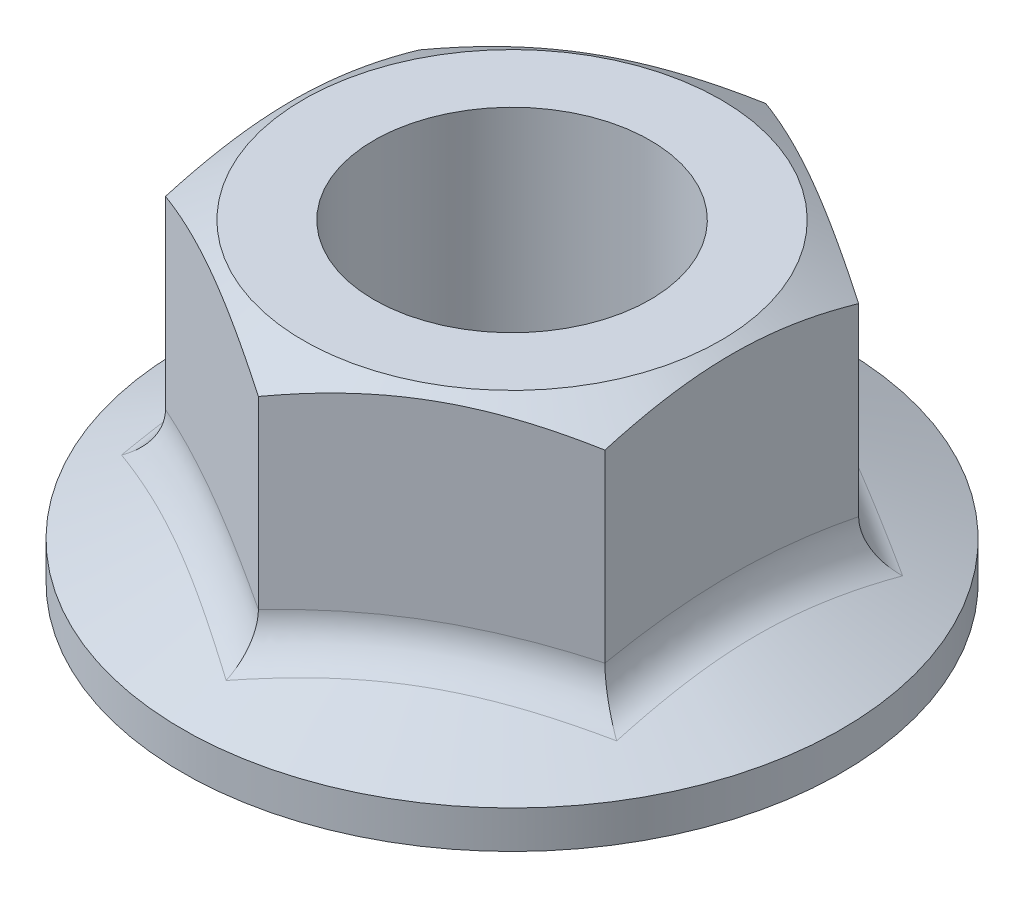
ISO-10303-21;
HEADER;
FILE_DESCRIPTION(('STEP AP214'),'2;1');
FILE_NAME('part.step','',(''),(''),'','','');
FILE_SCHEMA(('AUTOMOTIVE_DESIGN { 1 0 10303 214 1 1 1 1 }'));
ENDSEC;
DATA;
#1=APPLICATION_CONTEXT('core data for automotive mechanical design processes');
#2=APPLICATION_PROTOCOL_DEFINITION('international standard','automotive_design',2000,#1);
#3=PRODUCT_CONTEXT('',#1,'mechanical');
#4=PRODUCT('Part','Part','',(#3));
#5=PRODUCT_RELATED_PRODUCT_CATEGORY('part','',(#4));
#6=PRODUCT_DEFINITION_FORMATION('','',#4);
#7=PRODUCT_DEFINITION_CONTEXT('part definition',#1,'design');
#8=PRODUCT_DEFINITION('design','',#6,#7);
#9=PRODUCT_DEFINITION_SHAPE('','',#8);
#10=(LENGTH_UNIT() NAMED_UNIT(*) SI_UNIT(.MILLI.,.METRE.));
#11=(NAMED_UNIT(*) PLANE_ANGLE_UNIT() SI_UNIT($,.RADIAN.));
#12=(NAMED_UNIT(*) SI_UNIT($,.STERADIAN.) SOLID_ANGLE_UNIT());
#13=UNCERTAINTY_MEASURE_WITH_UNIT(LENGTH_MEASURE(1.E-05),#10,'distance_accuracy_value','');
#14=(GEOMETRIC_REPRESENTATION_CONTEXT(3) GLOBAL_UNCERTAINTY_ASSIGNED_CONTEXT((#13)) GLOBAL_UNIT_ASSIGNED_CONTEXT((#10,
#11,#12)) REPRESENTATION_CONTEXT('',''));
#15=CARTESIAN_POINT('',(0.,0.,0.));
#16=DIRECTION('',(0.,0.,1.));
#17=DIRECTION('',(1.,0.,0.));
#18=AXIS2_PLACEMENT_3D('',#15,#16,#17);
#19=CARTESIAN_POINT('',(-7.00000000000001,10.,-12.1243556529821));
#20=DIRECTION('',(0.,1.,0.));
#21=DIRECTION('',(0.,0.,1.));
#22=AXIS2_PLACEMENT_3D('',#19,#20,#21);
#23=PLANE('',#22);
#24=CARTESIAN_POINT('',(0.,10.,0.));
#25=DIRECTION('',(0.,-1.,0.));
#26=DIRECTION('',(0.,0.,-1.));
#27=AXIS2_PLACEMENT_3D('',#24,#25,#26);
#28=CIRCLE('',#27,6.65);
#29=CARTESIAN_POINT('',(0.,10.,-6.65));
#30=VERTEX_POINT('',#29);
#31=EDGE_CURVE('E459',#30,#30,#28,.T.);
#32=ORIENTED_EDGE('',*,*,#31,.F.);
#33=EDGE_LOOP('',(#32));
#34=FACE_BOUND('',#33,.T.);
#35=CARTESIAN_POINT('',(0.,10.,0.));
#36=DIRECTION('',(0.,1.,0.));
#37=DIRECTION('',(0.,0.,1.));
#38=AXIS2_PLACEMENT_3D('',#35,#36,#37);
#39=CIRCLE('',#38,4.4);
#40=CARTESIAN_POINT('',(0.,10.,4.4));
#41=VERTEX_POINT('',#40);
#42=EDGE_CURVE('E500',#41,#41,#39,.T.);
#43=ORIENTED_EDGE('',*,*,#42,.F.);
#44=EDGE_LOOP('',(#43));
#45=FACE_BOUND('',#44,.T.);
#46=ADVANCED_FACE('F33',(#34,#45),#23,.T.);
#47=CARTESIAN_POINT('',(-7.00000000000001,0.,-12.1243556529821));
#48=DIRECTION('',(0.,1.,0.));
#49=DIRECTION('',(0.,0.,1.));
#50=AXIS2_PLACEMENT_3D('',#47,#48,#49);
#51=PLANE('',#50);
#52=CARTESIAN_POINT('',(0.,0.,0.));
#53=DIRECTION('',(0.,-1.,0.));
#54=DIRECTION('',(0.,0.,-1.));
#55=AXIS2_PLACEMENT_3D('',#52,#53,#54);
#56=CIRCLE('',#55,10.5);
#57=CARTESIAN_POINT('',(0.,0.,-10.5));
#58=VERTEX_POINT('',#57);
#59=EDGE_CURVE('E437',#58,#58,#56,.T.);
#60=ORIENTED_EDGE('',*,*,#59,.T.);
#61=EDGE_LOOP('',(#60));
#62=FACE_BOUND('',#61,.T.);
#63=CARTESIAN_POINT('',(0.,0.,0.));
#64=DIRECTION('',(0.,1.,0.));
#65=DIRECTION('',(0.,0.,1.));
#66=AXIS2_PLACEMENT_3D('',#63,#64,#65);
#67=CIRCLE('',#66,4.4);
#68=CARTESIAN_POINT('',(0.,0.,4.4));
#69=VERTEX_POINT('',#68);
#70=EDGE_CURVE('E119',#69,#69,#67,.T.);
#71=ORIENTED_EDGE('',*,*,#70,.T.);
#72=EDGE_LOOP('',(#71));
#73=FACE_BOUND('',#72,.T.);
#74=ADVANCED_FACE('F476',(#62,#73),#51,.F.);
#75=CARTESIAN_POINT('',(6.99999999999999,10.,-4.04145188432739));
#76=DIRECTION('',(-0.5,0.,0.866025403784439));
#77=DIRECTION('',(0.866025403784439,0.,0.5));
#78=AXIS2_PLACEMENT_3D('',#75,#76,#77);
#79=PLANE('',#78);
#80=DIRECTION('',(0.,-1.,0.));
#81=VECTOR('',#80,1.);
#82=CARTESIAN_POINT('',(6.99999999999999,10.,-4.04145188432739));
#83=LINE('',#82,#81);
#84=CARTESIAN_POINT('',(6.99999999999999,9.17271262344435,-4.04145188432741));
#85=VERTEX_POINT('',#84);
#86=CARTESIAN_POINT('',(6.99999999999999,3.29419834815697,-4.04145188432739));
#87=VERTEX_POINT('',#86);
#88=EDGE_CURVE('E435',#85,#87,#83,.T.);
#89=ORIENTED_EDGE('',*,*,#88,.T.);
#90=CARTESIAN_POINT('',(9.42643847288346,2.58866653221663,-2.64054697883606));
#91=CARTESIAN_POINT('',(9.18267414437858,1.63297045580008,-2.78128437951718));
#92=CARTESIAN_POINT('',(9.57344876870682,1.31983563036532,-3.64257691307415));
#93=CARTESIAN_POINT('',(9.18356615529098,2.67123675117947,-2.78076937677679));
#94=CARTESIAN_POINT('',(8.94728972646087,1.71920219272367,-2.91718363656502));
#95=CARTESIAN_POINT('',(9.3348019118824,1.40240584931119,-3.77171602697));
#96=CARTESIAN_POINT('',(8.93996624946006,2.75105629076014,-2.92141184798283));
#97=CARTESIAN_POINT('',(8.71105727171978,1.80291553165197,-3.05357250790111));
#98=CARTESIAN_POINT('',(9.09597460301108,1.4822253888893,-3.9007983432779));
#99=CARTESIAN_POINT('',(8.4511198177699,2.90405176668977,-3.20364746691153));
#100=CARTESIAN_POINT('',(8.23780509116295,1.96360115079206,-3.32680478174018));
#101=CARTESIAN_POINT('',(8.6180306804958,1.63522086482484,-4.15906113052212));
#102=CARTESIAN_POINT('',(8.20587274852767,2.97722538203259,-3.34524092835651));
#103=CARTESIAN_POINT('',(8.00078899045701,2.04059817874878,-3.46364609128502));
#104=CARTESIAN_POINT('',(8.37891399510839,1.70839448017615,-4.28824161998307));
#105=CARTESIAN_POINT('',(7.71271165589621,3.11600846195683,-3.62996761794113));
#106=CARTESIAN_POINT('',(7.52503063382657,2.18684106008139,-3.73832530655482));
#107=CARTESIAN_POINT('',(7.89965958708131,1.84717756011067,-4.54734708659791));
#108=CARTESIAN_POINT('',(7.46479085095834,3.18158605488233,-3.77310476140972));
#109=CARTESIAN_POINT('',(7.28625798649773,2.25609587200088,-3.87618075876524));
#110=CARTESIAN_POINT('',(7.65952165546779,1.91275515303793,-4.67727295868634));
#111=CARTESIAN_POINT('',(6.96725472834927,3.30345325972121,-4.06035737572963));
#112=CARTESIAN_POINT('',(6.80798424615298,2.38494844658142,-4.15231223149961));
#113=CARTESIAN_POINT('',(7.17943710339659,2.03462235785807,-4.93759225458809));
#114=CARTESIAN_POINT('',(6.71763957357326,3.35974375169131,-4.20447275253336));
#115=CARTESIAN_POINT('',(6.56841914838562,2.44460156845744,-4.29062520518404));
#116=CARTESIAN_POINT('',(6.93949046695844,2.09091284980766,-5.06798563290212));
#117=CARTESIAN_POINT('',(6.22344563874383,3.46024011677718,-4.48979575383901));
#118=CARTESIAN_POINT('',(6.09499362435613,2.55119568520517,-4.56395755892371));
#119=CARTESIAN_POINT('',(6.46642340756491,2.19140921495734,-5.32608339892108));
#120=CARTESIAN_POINT('',(5.97891030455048,3.50472848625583,-4.63097829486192));
#121=CARTESIAN_POINT('',(5.86106646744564,2.5984887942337,-4.69901546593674));
#122=CARTESIAN_POINT('',(6.23329175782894,2.23589758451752,-5.45376664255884));
#123=CARTESIAN_POINT('',(5.488484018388,3.58223772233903,-4.9141260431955));
#124=CARTESIAN_POINT('',(5.39271610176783,2.68091654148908,-4.96941767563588));
#125=CARTESIAN_POINT('',(5.7676934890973,2.31340682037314,-5.71022626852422));
#126=CARTESIAN_POINT('',(5.24259316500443,3.61525941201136,-5.05609119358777));
#127=CARTESIAN_POINT('',(5.15813980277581,2.71611223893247,-5.10485036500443));
#128=CARTESIAN_POINT('',(5.53522682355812,2.34642850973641,-5.83900257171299));
#129=CARTESIAN_POINT('',(4.75025209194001,3.66866310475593,-5.34034444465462));
#130=CARTESIAN_POINT('',(4.68913199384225,2.77302351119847,-5.37563214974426));
#131=CARTESIAN_POINT('',(5.07160525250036,2.39983220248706,-6.0977388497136));
#132=CARTESIAN_POINT('',(4.50380387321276,3.68906942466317,-5.4826313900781));
#133=CARTESIAN_POINT('',(4.45450411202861,2.79481509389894,-5.51109462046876));
#134=CARTESIAN_POINT('',(4.84044867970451,2.42023852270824,-6.22769605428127));
#135=CARTESIAN_POINT('',(4.01034826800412,3.71657122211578,-5.76752811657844));
#136=CARTESIAN_POINT('',(3.98520563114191,2.82416252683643,-5.78204422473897));
#137=CARTESIAN_POINT('',(4.3791377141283,2.44774032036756,-6.48928918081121));
#138=CARTESIAN_POINT('',(3.76334089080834,3.72366691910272,-5.91013789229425));
#139=CARTESIAN_POINT('',(3.75030428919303,2.83174774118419,-5.91766457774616));
#140=CARTESIAN_POINT('',(4.14898330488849,2.45483601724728,-6.62092507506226));
#141=CARTESIAN_POINT('',(3.26737761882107,3.724266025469,-6.19648242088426));
#142=CARTESIAN_POINT('',(3.27889865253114,2.8323872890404,-6.18983074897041));
#143=CARTESIAN_POINT('',(3.68790725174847,2.45543512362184,-6.88702303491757));
#144=CARTESIAN_POINT('',(3.01842162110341,3.71766249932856,-6.34021723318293));
#145=CARTESIAN_POINT('',(3.04214807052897,2.82532794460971,-6.32651876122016));
#146=CARTESIAN_POINT('',(3.45699372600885,2.44883159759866,-7.02149916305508));
#147=CARTESIAN_POINT('',(2.52105808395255,3.69091495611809,-6.62737020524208));
#148=CARTESIAN_POINT('',(2.56915222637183,2.7967845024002,-6.59960303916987));
#149=CARTESIAN_POINT('',(2.99613851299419,2.42208405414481,-7.29219218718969));
#150=CARTESIAN_POINT('',(2.2726505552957,3.67077067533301,-6.77078835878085));
#151=CARTESIAN_POINT('',(2.3326698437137,2.7752712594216,-6.73613620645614));
#152=CARTESIAN_POINT('',(2.76619684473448,2.40193977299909,-7.42840911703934));
#153=CARTESIAN_POINT('',(1.77638573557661,3.61766502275,-7.057306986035));
#154=CARTESIAN_POINT('',(1.85995235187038,2.7186748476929,-7.00905977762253));
#155=CARTESIAN_POINT('',(2.30668823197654,2.34883412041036,-7.70260244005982));
#156=CARTESIAN_POINT('',(1.52853047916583,3.58467859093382,-7.20040628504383));
#157=CARTESIAN_POINT('',(1.62351499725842,2.68351413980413,-7.14556694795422));
#158=CARTESIAN_POINT('',(2.07712290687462,2.31584768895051,-7.84058176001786));
#159=CARTESIAN_POINT('',(1.0341912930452,3.50703276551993,-7.48581314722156));
#160=CARTESIAN_POINT('',(1.1514551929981,2.6009371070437,-7.41811080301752));
#161=CARTESIAN_POINT('',(1.61861961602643,2.23820186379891,-8.11768850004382));
#162=CARTESIAN_POINT('',(0.787707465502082,3.46237251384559,-7.62812065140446));
#163=CARTESIAN_POINT('',(0.915674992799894,2.55345833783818,-7.55423856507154));
#164=CARTESIAN_POINT('',(1.3896816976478,2.19354161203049,-8.25681600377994));
#165=CARTESIAN_POINT('',(0.289534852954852,3.36133708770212,-7.9157407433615));
#166=CARTESIAN_POINT('',(0.438457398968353,2.44628851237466,-7.8297602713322));
#167=CARTESIAN_POINT('',(0.925950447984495,2.09250618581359,-8.53967295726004));
#168=CARTESIAN_POINT('',(0.0378905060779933,3.3046722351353,-8.06102767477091));
#169=CARTESIAN_POINT('',(0.196950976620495,2.38623633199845,-7.96919406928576));
#170=CARTESIAN_POINT('',(0.691170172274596,2.03584133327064,-8.68342331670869));
#171=CARTESIAN_POINT('',(-0.463676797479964,3.18189973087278,-8.35060769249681));
#172=CARTESIAN_POINT('',(-0.285190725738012,2.25642477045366,-8.24755871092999));
#173=CARTESIAN_POINT('',(0.221923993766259,1.91306882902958,-8.97133152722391));
#174=CARTESIAN_POINT('',(-0.713599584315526,3.11579116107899,-8.49490068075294));
#175=CARTESIAN_POINT('',(-0.525891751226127,2.18660861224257,-8.38652751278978));
#176=CARTESIAN_POINT('',(-0.0125418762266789,1.84696025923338,-9.11548941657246));
#177=CARTESIAN_POINT('',(-1.21071647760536,2.97582940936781,-8.78191125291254));
#178=CARTESIAN_POINT('',(-1.00547283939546,2.03912571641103,-8.66341378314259));
#179=CARTESIAN_POINT('',(-0.480293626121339,1.70699850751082,-9.40328133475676));
#180=CARTESIAN_POINT('',(-1.45791756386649,2.90200901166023,-8.92463286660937));
#181=CARTESIAN_POINT('',(-1.24438390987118,1.96144999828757,-8.80134915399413));
#182=CARTESIAN_POINT('',(-0.713580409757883,1.6331781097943,-9.54691509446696));
#183=CARTESIAN_POINT('',(-1.95064552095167,2.7476267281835,-9.20910948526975));
#184=CARTESIAN_POINT('',(-1.72141327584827,1.79931418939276,-9.07676218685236));
#185=CARTESIAN_POINT('',(-1.17991984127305,1.47879582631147,-9.83397468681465));
#186=CARTESIAN_POINT('',(-2.19617295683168,2.66706725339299,-9.35086481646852));
#187=CARTESIAN_POINT('',(-1.95952757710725,1.71482894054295,-9.21423754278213));
#188=CARTESIAN_POINT('',(-1.41297254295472,1.3982363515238,-9.97740057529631));
#189=CARTESIAN_POINT('',(-2.44096243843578,2.58372349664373,-9.49219408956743));
#190=CARTESIAN_POINT('',(-2.19678065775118,1.62779683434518,-9.35121567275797));
#191=CARTESIAN_POINT('',(-1.64598400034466,1.31489259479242,-10.120637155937));
#192=(BOUNDED_SURFACE() B_SPLINE_SURFACE(3,2,((#90,#91,#92),(#93,#94,#95),(#96,#97,#98),(#99,
#100,#101),(#102,#103,#104),(#105,#106,#107),(#108,#109,#110),(#111,#112,#113),(#114,#115,#116),
(#117,#118,#119),(#120,#121,#122),(#123,#124,#125),(#126,#127,#128),(#129,#130,#131),(#132,#133,
#134),(#135,#136,#137),(#138,#139,#140),(#141,#142,#143),(#144,#145,#146),(#147,#148,#149),
(#150,#151,#152),(#153,#154,#155),(#156,#157,#158),(#159,#160,#161),(#162,#163,#164),(#165,#166,
#167),(#168,#169,#170),(#171,#172,#173),(#174,#175,#176),(#177,#178,#179),(#180,#181,#182),
(#183,#184,#185),(#186,#187,#188),(#189,#190,#191)),.UNSPECIFIED.,.F.,.F.,
.F.) B_SPLINE_SURFACE_WITH_KNOTS((4,2,2,2,2,2,2,2,2,2,2,2,2,2,2,2,4),(3,3),(0.,
0.877072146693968,1.75444943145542,2.63538403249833,3.51623510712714,4.37357075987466,
5.23084486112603,6.08646132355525,6.94206367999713,7.80436995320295,8.66669302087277,
9.53070731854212,10.394785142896,11.2827457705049,12.1707927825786,13.0552073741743,
13.9393068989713),(0.,1.),
.UNSPECIFIED.) GEOMETRIC_REPRESENTATION_ITEM() RATIONAL_B_SPLINE_SURFACE(((1.,0.814754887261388,
1.),(1.,0.816395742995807,1.),(1.,0.818061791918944,1.),(1.,0.821396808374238,1.),(1.,
0.82306577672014,1.),(1.,0.826364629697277,1.),(1.,0.827994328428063,1.),(1.,0.831136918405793,
1.),(1.,0.832649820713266,1.),(1.,0.83543617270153,1.),(1.,0.836714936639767,1.),(1.,
0.838995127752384,1.),(1.,0.839996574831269,1.),(1.,0.841640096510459,1.),(1.,0.842282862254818,
1.),(1.,0.843153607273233,1.),(1.,0.843381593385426,1.),(1.,0.843400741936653,1.),(1.,
0.843188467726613,1.),(1.,0.842341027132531,1.),(1.,0.841705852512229,1.),(1.,0.840069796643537,
1.),(1.,0.839068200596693,1.),(1.,0.83678153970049,1.),(1.,0.835496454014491,1.),(1.,
0.832692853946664,1.),(1.,0.83116886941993,1.),(1.,0.828001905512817,1.),(1.,0.826358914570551,
1.),(1.,0.823033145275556,1.),(1.,0.821350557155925,1.),(1.,0.817988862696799,1.),(1.,
0.81630975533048,1.),(1.,0.814656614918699,1.))) REPRESENTATION_ITEM('') SURFACE());
#193=CARTESIAN_POINT('',(9.42643847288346,2.58866653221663,-2.64054697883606));
#194=CARTESIAN_POINT('',(9.18356615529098,2.67123675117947,-2.78076937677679));
#195=CARTESIAN_POINT('',(8.93996624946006,2.75105629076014,-2.92141184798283));
#196=CARTESIAN_POINT('',(8.4511198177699,2.90405176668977,-3.20364746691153));
#197=CARTESIAN_POINT('',(8.20587274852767,2.97722538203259,-3.34524092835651));
#198=CARTESIAN_POINT('',(7.71271165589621,3.11600846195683,-3.62996761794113));
#199=CARTESIAN_POINT('',(7.46479085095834,3.18158605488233,-3.77310476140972));
#200=CARTESIAN_POINT('',(6.96725472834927,3.30345325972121,-4.06035737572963));
#201=CARTESIAN_POINT('',(6.71763957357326,3.35974375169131,-4.20447275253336));
#202=CARTESIAN_POINT('',(6.22344563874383,3.46024011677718,-4.48979575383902));
#203=CARTESIAN_POINT('',(5.97891030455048,3.50472848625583,-4.63097829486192));
#204=CARTESIAN_POINT('',(5.488484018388,3.58223772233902,-4.9141260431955));
#205=CARTESIAN_POINT('',(5.24259316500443,3.61525941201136,-5.05609119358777));
#206=CARTESIAN_POINT('',(4.75025209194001,3.66866310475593,-5.34034444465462));
#207=CARTESIAN_POINT('',(4.50380387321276,3.68906942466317,-5.4826313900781));
#208=CARTESIAN_POINT('',(4.01034826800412,3.71657122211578,-5.76752811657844));
#209=CARTESIAN_POINT('',(3.76334089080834,3.72366691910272,-5.91013789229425));
#210=CARTESIAN_POINT('',(3.26737761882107,3.724266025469,-6.19648242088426));
#211=CARTESIAN_POINT('',(3.01842162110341,3.71766249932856,-6.34021723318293));
#212=CARTESIAN_POINT('',(2.52105808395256,3.69091495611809,-6.62737020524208));
#213=CARTESIAN_POINT('',(2.2726505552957,3.67077067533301,-6.77078835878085));
#214=CARTESIAN_POINT('',(1.77638573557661,3.61766502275,-7.057306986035));
#215=CARTESIAN_POINT('',(1.52853047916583,3.58467859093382,-7.20040628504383));
#216=CARTESIAN_POINT('',(1.0341912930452,3.50703276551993,-7.48581314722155));
#217=CARTESIAN_POINT('',(0.787707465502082,3.46237251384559,-7.62812065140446));
#218=CARTESIAN_POINT('',(0.289534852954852,3.36133708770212,-7.91574074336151));
#219=CARTESIAN_POINT('',(0.0378905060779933,3.3046722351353,-8.06102767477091));
#220=CARTESIAN_POINT('',(-0.463676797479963,3.18189973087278,-8.35060769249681));
#221=CARTESIAN_POINT('',(-0.713599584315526,3.11579116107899,-8.49490068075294));
#222=CARTESIAN_POINT('',(-1.21071647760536,2.97582940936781,-8.78191125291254));
#223=CARTESIAN_POINT('',(-1.45791756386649,2.90200901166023,-8.92463286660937));
#224=CARTESIAN_POINT('',(-1.95064552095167,2.7476267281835,-9.20910948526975));
#225=CARTESIAN_POINT('',(-2.19617295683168,2.66706725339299,-9.35086481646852));
#226=CARTESIAN_POINT('',(-2.44096243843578,2.58372349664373,-9.49219408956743));
#227=B_SPLINE_CURVE_WITH_KNOTS('',3,(#193,#194,#195,#196,#197,#198,#199,#200,#201,#202,#203,
#204,#205,#206,#207,#208,#209,#210,#211,#212,#213,#214,#215,#216,#217,#218,#219,#220,#221,#222,
#223,#224,#225,#226),.UNSPECIFIED.,.F.,.F.,(4,2,2,2,2,2,2,2,2,2,2,2,2,2,2,2,4),(0.,
0.877072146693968,1.75444943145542,2.63538403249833,3.51623510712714,4.37357075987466,
5.23084486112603,6.08646132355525,6.94206367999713,7.80436995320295,8.66669302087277,
9.53070731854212,10.394785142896,11.2827457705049,12.1707927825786,13.0552073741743,
13.9393068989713),.UNSPECIFIED.);
#228=CARTESIAN_POINT('',(0.,3.29419834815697,-8.08290376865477));
#229=VERTEX_POINT('',#228);
#230=EDGE_CURVE('E11',#87,#229,#227,.T.);
#231=ORIENTED_EDGE('',*,*,#230,.T.);
#232=DIRECTION('',(0.,-1.,0.));
#233=VECTOR('',#232,1.);
#234=CARTESIAN_POINT('',(0.,10.,-8.08290376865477));
#235=LINE('',#234,#233);
#236=CARTESIAN_POINT('',(0.,9.17271262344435,-8.08290376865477));
#237=VERTEX_POINT('',#236);
#238=EDGE_CURVE('E122',#237,#229,#235,.T.);
#239=ORIENTED_EDGE('',*,*,#238,.F.);
#240=CARTESIAN_POINT('',(-0.000199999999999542,9.17264595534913,-8.08301923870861));
#241=CARTESIAN_POINT('',(0.153667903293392,9.22392755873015,-7.99418356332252));
#242=CARTESIAN_POINT('',(0.308109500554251,9.27288181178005,-7.90501666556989));
#243=CARTESIAN_POINT('',(0.618246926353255,9.3654946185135,-7.72595873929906));
#244=CARTESIAN_POINT('',(0.773943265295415,9.40915088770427,-7.63606741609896));
#245=CARTESIAN_POINT('',(1.24352516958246,9.53131581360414,-7.36495417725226));
#246=CARTESIAN_POINT('',(1.5592643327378,9.60080184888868,-7.18266208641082));
#247=CARTESIAN_POINT('',(2.03176224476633,9.68228244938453,-6.90986528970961));
#248=CARTESIAN_POINT('',(2.18710922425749,9.70549392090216,-6.82017566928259));
#249=CARTESIAN_POINT('',(2.49850511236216,9.74441619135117,-6.64039116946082));
#250=CARTESIAN_POINT('',(2.65455395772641,9.7601276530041,-6.55029632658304));
#251=CARTESIAN_POINT('',(2.96692267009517,9.78364949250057,-6.36995016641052));
#252=CARTESIAN_POINT('',(3.12324202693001,9.79146883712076,-6.27969914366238));
#253=CARTESIAN_POINT('',(3.43601650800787,9.79904716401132,-6.09911871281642));
#254=CARTESIAN_POINT('',(3.59247162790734,9.79880639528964,-6.00878930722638));
#255=CARTESIAN_POINT('',(4.02110687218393,9.78706767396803,-5.76131663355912));
#256=CARTESIAN_POINT('',(4.2931466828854,9.76736166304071,-5.60425437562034));
#257=CARTESIAN_POINT('',(4.83541944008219,9.70487394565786,-5.29117305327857));
#258=CARTESIAN_POINT('',(5.10565047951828,9.66207088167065,-5.13515508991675));
#259=CARTESIAN_POINT('',(5.64901454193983,9.55507572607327,-4.8214437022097));
#260=CARTESIAN_POINT('',(5.92207900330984,9.49043031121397,-4.66378986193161));
#261=CARTESIAN_POINT('',(6.46413578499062,9.3437113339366,-4.35083323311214));
#262=CARTESIAN_POINT('',(6.73313504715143,9.26167223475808,-4.19552643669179));
#263=CARTESIAN_POINT('',(7.00019999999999,9.17264595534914,-4.04133641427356));
#264=B_SPLINE_CURVE_WITH_KNOTS('',3,(#240,#241,#242,#243,#244,#245,#246,#247,#248,#249,#250,
#251,#252,#253,#254,#255,#256,#257,#258,#259,#260,#261,#262,#263),.UNSPECIFIED.,.F.,.F.,(4,2,2,
2,2,2,2,2,2,2,2,4),(0.,0.554727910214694,1.10969417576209,2.2219327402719,2.76443041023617,
3.30688013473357,3.8487128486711,4.39052882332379,5.33376515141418,6.27787517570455,
7.24292418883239,8.20607866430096),.UNSPECIFIED.);
#265=EDGE_CURVE('E111',#237,#85,#264,.T.);
#266=ORIENTED_EDGE('',*,*,#265,.T.);
#267=EDGE_LOOP('',(#89,#231,#239,#266));
#268=FACE_BOUND('',#267,.T.);
#269=ADVANCED_FACE('F126',(#268),#79,.F.);
#270=CARTESIAN_POINT('',(0.,10.,-8.08290376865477));
#271=DIRECTION('',(0.5,0.,0.866025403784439));
#272=DIRECTION('',(0.866025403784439,0.,-0.5));
#273=AXIS2_PLACEMENT_3D('',#270,#271,#272);
#274=PLANE('',#273);
#275=ORIENTED_EDGE('',*,*,#238,.T.);
#276=CARTESIAN_POINT('',(2.42643847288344,2.58866653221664,-9.48380867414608));
#277=CARTESIAN_POINT('',(2.18267414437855,1.63297045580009,-9.34307127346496));
#278=CARTESIAN_POINT('',(1.63216024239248,1.31983563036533,-10.112138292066));
#279=CARTESIAN_POINT('',(2.18356615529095,2.67123675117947,-9.34358627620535));
#280=CARTESIAN_POINT('',(1.94728972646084,1.71920219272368,-9.20717201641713));
#281=CARTESIAN_POINT('',(1.40099906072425,1.4024058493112,-9.97003360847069));
#282=CARTESIAN_POINT('',(1.93996624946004,2.75105629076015,-9.20294380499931));
#283=CARTESIAN_POINT('',(1.71105727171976,1.80291553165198,-9.07078314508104));
#284=CARTESIAN_POINT('',(1.16979684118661,1.48222538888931,-9.82774425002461));
#285=CARTESIAN_POINT('',(1.45111981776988,2.90405176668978,-8.92070818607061));
#286=CARTESIAN_POINT('',(1.23780509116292,1.96360115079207,-8.79755087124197));
#287=CARTESIAN_POINT('',(0.707162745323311,1.63522086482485,-9.54296406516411));
#288=CARTESIAN_POINT('',(1.20587274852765,2.9772253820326,-8.77911472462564));
#289=CARTESIAN_POINT('',(1.00078899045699,2.04059817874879,-8.66070956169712));
#290=CARTESIAN_POINT('',(0.475730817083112,1.70839448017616,-9.40047318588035));
#291=CARTESIAN_POINT('',(0.712711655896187,3.11600846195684,-8.49438803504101));
#292=CARTESIAN_POINT('',(0.525030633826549,2.18684106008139,-8.38603034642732));
#293=CARTESIAN_POINT('',(0.0117116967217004,1.84717756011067,-9.11497942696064));
#294=CARTESIAN_POINT('',(0.46479085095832,3.18158605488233,-8.35125089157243));
#295=CARTESIAN_POINT('',(0.286257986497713,2.25609587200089,-8.2481748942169));
#296=CARTESIAN_POINT('',(-0.22087637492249,1.91275515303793,-8.97197681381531));
#297=CARTESIAN_POINT('',(-0.032745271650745,3.30345325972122,-8.06399827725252));
#298=CARTESIAN_POINT('',(-0.192015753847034,2.38494844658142,-7.97204342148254));
#299=CARTESIAN_POINT('',(-0.686361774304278,2.03462235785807,-8.68637104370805));
#300=CARTESIAN_POINT('',(-0.282360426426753,3.35974375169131,-7.91988290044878));
#301=CARTESIAN_POINT('',(-0.431580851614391,2.44460156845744,-7.83373044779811));
#302=CARTESIAN_POINT('',(-0.919259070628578,2.09091284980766,-8.543767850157));
#303=CARTESIAN_POINT('',(-0.776554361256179,3.46024011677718,-7.63455989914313));
#304=CARTESIAN_POINT('',(-0.905006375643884,2.55119568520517,-7.56039809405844));
#305=CARTESIAN_POINT('',(-1.37931182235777,2.19140921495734,-8.26312864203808));
#306=CARTESIAN_POINT('',(-1.02108969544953,3.50472848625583,-7.49337735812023));
#307=CARTESIAN_POINT('',(-1.13893353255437,2.5984887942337,-7.42534018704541));
#308=CARTESIAN_POINT('',(-1.60645457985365,2.23589758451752,-8.12507233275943));
#309=CARTESIAN_POINT('',(-1.51151598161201,3.58223772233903,-7.21022960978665));
#310=CARTESIAN_POINT('',(-1.60728389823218,2.68091654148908,-7.15493797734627));
#311=CARTESIAN_POINT('',(-2.06135426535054,2.31340682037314,-7.85008221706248));
#312=CARTESIAN_POINT('',(-1.75740683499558,3.61525941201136,-7.06826445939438));
#313=CARTESIAN_POINT('',(-1.84186019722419,2.71611223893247,-7.01950528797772));
#314=CARTESIAN_POINT('',(-2.28911114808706,2.34642850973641,-7.71314833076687));
#315=CARTESIAN_POINT('',(-2.24974790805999,3.66866310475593,-6.78401120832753));
#316=CARTESIAN_POINT('',(-2.31086800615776,2.77302351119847,-6.74872350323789));
#317=CARTESIAN_POINT('',(-2.74499412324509,2.39983220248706,-7.44100841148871));
#318=CARTESIAN_POINT('',(-2.49619612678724,3.68906942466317,-6.64172426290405));
#319=CARTESIAN_POINT('',(-2.54549588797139,2.79481509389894,-6.6132610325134));
#320=CARTESIAN_POINT('',(-2.97311865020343,2.42023852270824,-7.30579954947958));
#321=CARTESIAN_POINT('',(-2.98965173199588,3.71657122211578,-6.35682753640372));
#322=CARTESIAN_POINT('',(-3.01479436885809,2.82416252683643,-6.34231142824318));
#323=CARTESIAN_POINT('',(-3.43032042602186,2.44774032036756,-7.03708909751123));
#324=CARTESIAN_POINT('',(-3.23665910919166,3.72366691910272,-6.21421776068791));
#325=CARTESIAN_POINT('',(-3.24969571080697,2.83174774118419,-6.20669107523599));
#326=CARTESIAN_POINT('',(-3.65939765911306,2.45483601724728,-6.90358747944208));
#327=CARTESIAN_POINT('',(-3.73262238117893,3.724266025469,-5.92787323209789));
#328=CARTESIAN_POINT('',(-3.72110134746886,2.8323872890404,-5.93452490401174));
#329=CARTESIAN_POINT('',(-4.12038327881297,2.45543512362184,-6.63733288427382));
#330=CARTESIAN_POINT('',(-3.98157837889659,3.71766249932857,-5.78413841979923));
#331=CARTESIAN_POINT('',(-3.95785192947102,2.82532794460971,-5.79783689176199));
#332=CARTESIAN_POINT('',(-4.35229978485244,2.44883159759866,-6.50459396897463));
#333=CARTESIAN_POINT('',(-4.47894191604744,3.69091495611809,-5.49698544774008));
#334=CARTESIAN_POINT('',(-4.43084777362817,2.7967845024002,-5.52475261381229));
#335=CARTESIAN_POINT('',(-4.81715442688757,2.42208405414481,-6.24082815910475));
#336=CARTESIAN_POINT('',(-4.7273494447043,3.67077067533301,-5.35356729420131));
#337=CARTESIAN_POINT('',(-4.6673301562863,2.7752712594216,-5.38821944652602));
#338=CARTESIAN_POINT('',(-5.05009258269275,2.40193977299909,-6.10980129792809));
#339=CARTESIAN_POINT('',(-5.22361426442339,3.61766502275,-5.06704866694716));
#340=CARTESIAN_POINT('',(-5.14004764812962,2.7186748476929,-5.11529587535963));
#341=CARTESIAN_POINT('',(-5.51730527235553,2.34883412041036,-5.84895182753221));
#342=CARTESIAN_POINT('',(-5.47146952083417,3.58467859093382,-4.92394936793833));
#343=CARTESIAN_POINT('',(-5.37648500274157,2.68351413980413,-4.97878870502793));
#344=CARTESIAN_POINT('',(-5.75158153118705,2.31584768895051,-5.71913208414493));
#345=CARTESIAN_POINT('',(-5.9658087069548,3.50703276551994,-4.6385425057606));
#346=CARTESIAN_POINT('',(-5.8485448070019,2.60093710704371,-4.70624484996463));
#347=CARTESIAN_POINT('',(-6.22081465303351,2.23820186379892,-5.46060995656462));
#348=CARTESIAN_POINT('',(-6.21229253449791,3.46237251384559,-4.49623500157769));
#349=CARTESIAN_POINT('',(-6.0843250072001,2.55345833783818,-4.57011708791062));
#350=CARTESIAN_POINT('',(-6.45577156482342,2.1935416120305,-5.33190765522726));
#351=CARTESIAN_POINT('',(-6.71046514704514,3.36133708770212,-4.20861490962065));
#352=CARTESIAN_POINT('',(-6.56154260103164,2.44628851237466,-4.29459538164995));
#353=CARTESIAN_POINT('',(-6.93259849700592,2.09250618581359,-5.07173308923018));
#354=CARTESIAN_POINT('',(-6.962109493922,3.3046722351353,-4.06332797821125));
#355=CARTESIAN_POINT('',(-6.8030490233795,2.38623633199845,-4.15516158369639));
#356=CARTESIAN_POINT('',(-7.17448009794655,2.03584133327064,-4.94028258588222));
#357=CARTESIAN_POINT('',(-7.46367679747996,3.18189973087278,-3.77374796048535));
#358=CARTESIAN_POINT('',(-7.28519072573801,2.25642477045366,-3.87679694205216));
#359=CARTESIAN_POINT('',(-7.65843901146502,1.91306882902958,-4.67785757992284));
#360=CARTESIAN_POINT('',(-7.71359958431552,3.115791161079,-3.62945497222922));
#361=CARTESIAN_POINT('',(-7.52589175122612,2.18660861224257,-3.73782814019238));
#362=CARTESIAN_POINT('',(-7.90051634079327,1.84696025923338,-4.54688312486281));
#363=CARTESIAN_POINT('',(-8.21071647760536,2.97582940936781,-3.34244440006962));
#364=CARTESIAN_POINT('',(-8.00547283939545,2.03912571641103,-3.46094186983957));
#365=CARTESIAN_POINT('',(-8.38362732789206,1.70699850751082,-4.28569418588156));
#366=CARTESIAN_POINT('',(-8.45791756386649,2.90200901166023,-3.19972278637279));
#367=CARTESIAN_POINT('',(-8.24438390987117,1.96144999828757,-3.32300649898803));
#368=CARTESIAN_POINT('',(-8.62466120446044,1.6331781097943,-4.15547878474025));
#369=CARTESIAN_POINT('',(-8.95064552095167,2.7476267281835,-2.91524616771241));
#370=CARTESIAN_POINT('',(-8.72141327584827,1.79931418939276,-3.04759346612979));
#371=CARTESIAN_POINT('',(-9.10643181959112,1.47879582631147,-3.89514678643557));
#372=CARTESIAN_POINT('',(-9.19617295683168,2.667067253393,-2.77349083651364));
#373=CARTESIAN_POINT('',(-8.95952757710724,1.71482894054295,-2.91011811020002));
#374=CARTESIAN_POINT('',(-9.34716863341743,1.39823635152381,-3.76503017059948));
#375=CARTESIAN_POINT('',(-9.44096243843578,2.58372349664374,-2.63216156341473));
#376=CARTESIAN_POINT('',(-9.19678065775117,1.62779683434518,-2.77313998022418));
#377=CARTESIAN_POINT('',(-9.58772087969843,1.31489259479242,-3.63485461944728));
#378=(BOUNDED_SURFACE() B_SPLINE_SURFACE(3,2,((#276,#277,#278),(#279,#280,#281),(#282,#283,
#284),(#285,#286,#287),(#288,#289,#290),(#291,#292,#293),(#294,#295,#296),(#297,#298,#299),
(#300,#301,#302),(#303,#304,#305),(#306,#307,#308),(#309,#310,#311),(#312,#313,#314),(#315,#316,
#317),(#318,#319,#320),(#321,#322,#323),(#324,#325,#326),(#327,#328,#329),(#330,#331,#332),
(#333,#334,#335),(#336,#337,#338),(#339,#340,#341),(#342,#343,#344),(#345,#346,#347),(#348,#349,
#350),(#351,#352,#353),(#354,#355,#356),(#357,#358,#359),(#360,#361,#362),(#363,#364,#365),
(#366,#367,#368),(#369,#370,#371),(#372,#373,#374),(#375,#376,#377)),.UNSPECIFIED.,.F.,.F.,
.F.) B_SPLINE_SURFACE_WITH_KNOTS((4,2,2,2,2,2,2,2,2,2,2,2,2,2,2,2,4),(3,3),(0.,
0.877072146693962,1.75444943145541,2.63538403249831,3.51623510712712,4.37357075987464,
5.230844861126,6.08646132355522,6.94206367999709,7.80436995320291,8.66669302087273,
9.53070731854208,10.3947851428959,11.2827457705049,12.1707927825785,13.0552073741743,
13.9393068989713),(0.,1.),
.UNSPECIFIED.) GEOMETRIC_REPRESENTATION_ITEM() RATIONAL_B_SPLINE_SURFACE(((1.,0.814754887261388,
1.),(1.,0.816395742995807,1.),(1.,0.818061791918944,1.),(1.,0.821396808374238,1.),(1.,
0.823065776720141,1.),(1.,0.826364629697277,1.),(1.,0.827994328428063,1.),(1.,0.831136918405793,
1.),(1.,0.832649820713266,1.),(1.,0.83543617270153,1.),(1.,0.836714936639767,1.),(1.,
0.838995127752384,1.),(1.,0.839996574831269,1.),(1.,0.841640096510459,1.),(1.,0.842282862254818,
1.),(1.,0.843153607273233,1.),(1.,0.843381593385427,1.),(1.,0.843400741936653,1.),(1.,
0.843188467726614,1.),(1.,0.842341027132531,1.),(1.,0.841705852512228,1.),(1.,0.840069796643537,
1.),(1.,0.839068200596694,1.),(1.,0.836781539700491,1.),(1.,0.835496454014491,1.),(1.,
0.832692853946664,1.),(1.,0.83116886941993,1.),(1.,0.828001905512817,1.),(1.,0.826358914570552,
1.),(1.,0.823033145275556,1.),(1.,0.821350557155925,1.),(1.,0.817988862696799,1.),(1.,
0.81630975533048,1.),(1.,0.814656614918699,1.))) REPRESENTATION_ITEM('') SURFACE());
#379=CARTESIAN_POINT('',(2.42643847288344,2.58866653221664,-9.48380867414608));
#380=CARTESIAN_POINT('',(2.18356615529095,2.67123675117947,-9.34358627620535));
#381=CARTESIAN_POINT('',(1.93996624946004,2.75105629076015,-9.20294380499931));
#382=CARTESIAN_POINT('',(1.45111981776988,2.90405176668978,-8.92070818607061));
#383=CARTESIAN_POINT('',(1.20587274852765,2.9772253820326,-8.77911472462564));
#384=CARTESIAN_POINT('',(0.712711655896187,3.11600846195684,-8.49438803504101));
#385=CARTESIAN_POINT('',(0.46479085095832,3.18158605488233,-8.35125089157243));
#386=CARTESIAN_POINT('',(-0.0327452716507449,3.30345325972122,-8.06399827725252));
#387=CARTESIAN_POINT('',(-0.282360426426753,3.35974375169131,-7.91988290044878));
#388=CARTESIAN_POINT('',(-0.776554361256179,3.46024011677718,-7.63455989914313));
#389=CARTESIAN_POINT('',(-1.02108969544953,3.50472848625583,-7.49337735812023));
#390=CARTESIAN_POINT('',(-1.51151598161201,3.58223772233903,-7.21022960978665));
#391=CARTESIAN_POINT('',(-1.75740683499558,3.61525941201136,-7.06826445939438));
#392=CARTESIAN_POINT('',(-2.24974790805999,3.66866310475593,-6.78401120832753));
#393=CARTESIAN_POINT('',(-2.49619612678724,3.68906942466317,-6.64172426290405));
#394=CARTESIAN_POINT('',(-2.98965173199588,3.71657122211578,-6.35682753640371));
#395=CARTESIAN_POINT('',(-3.23665910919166,3.72366691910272,-6.21421776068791));
#396=CARTESIAN_POINT('',(-3.73262238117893,3.724266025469,-5.92787323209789));
#397=CARTESIAN_POINT('',(-3.98157837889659,3.71766249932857,-5.78413841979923));
#398=CARTESIAN_POINT('',(-4.47894191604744,3.69091495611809,-5.49698544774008));
#399=CARTESIAN_POINT('',(-4.7273494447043,3.67077067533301,-5.35356729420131));
#400=CARTESIAN_POINT('',(-5.22361426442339,3.61766502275,-5.06704866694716));
#401=CARTESIAN_POINT('',(-5.47146952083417,3.58467859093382,-4.92394936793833));
#402=CARTESIAN_POINT('',(-5.9658087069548,3.50703276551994,-4.6385425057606));
#403=CARTESIAN_POINT('',(-6.21229253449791,3.46237251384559,-4.49623500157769));
#404=CARTESIAN_POINT('',(-6.71046514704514,3.36133708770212,-4.20861490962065));
#405=CARTESIAN_POINT('',(-6.962109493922,3.3046722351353,-4.06332797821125));
#406=CARTESIAN_POINT('',(-7.46367679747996,3.18189973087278,-3.77374796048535));
#407=CARTESIAN_POINT('',(-7.71359958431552,3.115791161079,-3.62945497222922));
#408=CARTESIAN_POINT('',(-8.21071647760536,2.97582940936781,-3.34244440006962));
#409=CARTESIAN_POINT('',(-8.45791756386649,2.90200901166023,-3.19972278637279));
#410=CARTESIAN_POINT('',(-8.95064552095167,2.7476267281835,-2.91524616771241));
#411=CARTESIAN_POINT('',(-9.19617295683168,2.667067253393,-2.77349083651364));
#412=CARTESIAN_POINT('',(-9.44096243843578,2.58372349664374,-2.63216156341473));
#413=B_SPLINE_CURVE_WITH_KNOTS('',3,(#379,#380,#381,#382,#383,#384,#385,#386,#387,#388,#389,
#390,#391,#392,#393,#394,#395,#396,#397,#398,#399,#400,#401,#402,#403,#404,#405,#406,#407,#408,
#409,#410,#411,#412),.UNSPECIFIED.,.F.,.F.,(4,2,2,2,2,2,2,2,2,2,2,2,2,2,2,2,4),(0.,
0.877072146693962,1.75444943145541,2.63538403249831,3.51623510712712,4.37357075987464,
5.230844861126,6.08646132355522,6.94206367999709,7.80436995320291,8.66669302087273,
9.53070731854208,10.3947851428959,11.2827457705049,12.1707927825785,13.0552073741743,
13.9393068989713),.UNSPECIFIED.);
#414=CARTESIAN_POINT('',(-7.00000000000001,3.29419834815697,-4.04145188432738));
#415=VERTEX_POINT('',#414);
#416=EDGE_CURVE('E48',#229,#415,#413,.T.);
#417=ORIENTED_EDGE('',*,*,#416,.T.);
#418=DIRECTION('',(0.,-1.,0.));
#419=VECTOR('',#418,1.);
#420=CARTESIAN_POINT('',(-7.00000000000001,10.,-4.04145188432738));
#421=LINE('',#420,#419);
#422=CARTESIAN_POINT('',(-7.00000000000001,9.17271262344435,-4.04145188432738));
#423=VERTEX_POINT('',#422);
#424=EDGE_CURVE('E123',#423,#415,#421,.T.);
#425=ORIENTED_EDGE('',*,*,#424,.F.);
#426=CARTESIAN_POINT('',(-7.00020000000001,9.17264595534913,-4.04133641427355));
#427=CARTESIAN_POINT('',(-6.84633209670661,9.22392755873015,-4.13017208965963));
#428=CARTESIAN_POINT('',(-6.69189049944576,9.27288181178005,-4.21933898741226));
#429=CARTESIAN_POINT('',(-6.38175307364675,9.3654946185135,-4.39839691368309));
#430=CARTESIAN_POINT('',(-6.22605673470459,9.40915088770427,-4.48828823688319));
#431=CARTESIAN_POINT('',(-5.75647483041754,9.53131581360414,-4.7594014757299));
#432=CARTESIAN_POINT('',(-5.4407356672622,9.60080184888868,-4.94169356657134));
#433=CARTESIAN_POINT('',(-4.96823775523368,9.68228244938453,-5.21449036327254));
#434=CARTESIAN_POINT('',(-4.81289077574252,9.70549392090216,-5.30417998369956));
#435=CARTESIAN_POINT('',(-4.50149488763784,9.74441619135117,-5.48396448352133));
#436=CARTESIAN_POINT('',(-4.3454460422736,9.7601276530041,-5.57405932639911));
#437=CARTESIAN_POINT('',(-4.03307732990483,9.78364949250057,-5.75440548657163));
#438=CARTESIAN_POINT('',(-3.87675797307,9.79146883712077,-5.84465650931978));
#439=CARTESIAN_POINT('',(-3.56398349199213,9.79904716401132,-6.02523694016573));
#440=CARTESIAN_POINT('',(-3.40752837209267,9.79880639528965,-6.11556634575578));
#441=CARTESIAN_POINT('',(-2.97889312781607,9.78706767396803,-6.36303901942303));
#442=CARTESIAN_POINT('',(-2.70685331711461,9.76736166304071,-6.52010127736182));
#443=CARTESIAN_POINT('',(-2.16458055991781,9.70487394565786,-6.83318259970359));
#444=CARTESIAN_POINT('',(-1.89434952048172,9.66207088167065,-6.98920056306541));
#445=CARTESIAN_POINT('',(-1.35098545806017,9.55507572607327,-7.30291195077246));
#446=CARTESIAN_POINT('',(-1.07792099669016,9.49043031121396,-7.46056579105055));
#447=CARTESIAN_POINT('',(-0.535864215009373,9.34371133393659,-7.77352241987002));
#448=CARTESIAN_POINT('',(-0.266864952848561,9.26167223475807,-7.92882921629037));
#449=CARTESIAN_POINT('',(0.000200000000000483,9.17264595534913,-8.08301923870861));
#450=B_SPLINE_CURVE_WITH_KNOTS('',3,(#426,#427,#428,#429,#430,#431,#432,#433,#434,#435,#436,
#437,#438,#439,#440,#441,#442,#443,#444,#445,#446,#447,#448,#449),.UNSPECIFIED.,.F.,.F.,(4,2,2,
2,2,2,2,2,2,2,2,4),(0.,0.554727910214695,1.10969417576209,2.2219327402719,2.76443041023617,
3.30688013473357,3.8487128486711,4.39052882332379,5.33376515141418,6.27787517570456,
7.2429241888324,8.20607866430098),.UNSPECIFIED.);
#451=EDGE_CURVE('E114',#423,#237,#450,.T.);
#452=ORIENTED_EDGE('',*,*,#451,.T.);
#453=EDGE_LOOP('',(#275,#417,#425,#452));
#454=FACE_BOUND('',#453,.T.);
#455=ADVANCED_FACE('F121',(#454),#274,.F.);
#456=CARTESIAN_POINT('',(-7.00000000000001,10.,-4.04145188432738));
#457=DIRECTION('',(1.,0.,0.));
#458=DIRECTION('',(0.,0.,-1.));
#459=AXIS2_PLACEMENT_3D('',#456,#457,#458);
#460=PLANE('',#459);
#461=ORIENTED_EDGE('',*,*,#424,.T.);
#462=CARTESIAN_POINT('',(-7.00000000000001,2.57970534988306,-6.87364727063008));
#463=CARTESIAN_POINT('',(-7.00000000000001,1.62359149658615,-6.59129986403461));
#464=CARTESIAN_POINT('',(-7.94210069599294,1.31087444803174,-6.49895223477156));
#465=CARTESIAN_POINT('',(-7.00000000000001,2.66307864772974,-6.59122455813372));
#466=CARTESIAN_POINT('',(-7.00000000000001,1.71065010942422,-6.31755754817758));
#467=CARTESIAN_POINT('',(-7.93456914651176,1.39424774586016,-6.22574633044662));
#468=CARTESIAN_POINT('',(-7.00000000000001,2.74367955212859,-6.30795250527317));
#469=CARTESIAN_POINT('',(-7.00000000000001,1.79517385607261,-6.04282377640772));
#470=CARTESIAN_POINT('',(-7.92689356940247,1.47484865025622,-5.95240996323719));
#471=CARTESIAN_POINT('',(-7.00000000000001,2.89817375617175,-5.73948227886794));
#472=CARTESIAN_POINT('',(-7.00000000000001,1.95741783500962,-5.49243404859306));
#473=CARTESIAN_POINT('',(-7.91147615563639,1.62934285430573,-5.40543089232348));
#474=CARTESIAN_POINT('',(-7.00000000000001,2.97206467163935,-5.45428345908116));
#475=CARTESIAN_POINT('',(-7.00000000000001,2.03516295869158,-5.21678319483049));
#476=CARTESIAN_POINT('',(-7.90373429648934,1.70323376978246,-5.13178811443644));
#477=CARTESIAN_POINT('',(-7.00000000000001,3.11220371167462,-4.88075195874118));
#478=CARTESIAN_POINT('',(-7.00000000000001,2.18282382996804,-4.66344844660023));
#479=CARTESIAN_POINT('',(-7.88838017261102,1.84337280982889,-4.58321559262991));
#480=CARTESIAN_POINT('',(-7.00000000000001,3.17841906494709,-4.59241120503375));
#481=CARTESIAN_POINT('',(-7.00000000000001,2.25274823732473,-4.3857295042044));
#482=CARTESIAN_POINT('',(-7.88076857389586,1.90958816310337,-4.30828519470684));
#483=CARTESIAN_POINT('',(-7.00000000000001,3.30144528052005,-4.01374412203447));
#484=CARTESIAN_POINT('',(-7.00000000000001,2.38282025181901,-3.82943769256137));
#485=CARTESIAN_POINT('',(-7.86604789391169,2.03261437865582,-3.75835459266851));
#486=CARTESIAN_POINT('',(-7.00000000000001,3.35825704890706,-3.72341798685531));
#487=CARTESIAN_POINT('',(-7.00000000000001,2.44302426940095,-3.55079004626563));
#488=CARTESIAN_POINT('',(-7.85893876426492,2.08942614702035,-3.48335439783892));
#489=CARTESIAN_POINT('',(-7.00000000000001,3.45962353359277,-3.14867885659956));
#490=CARTESIAN_POINT('',(-7.00000000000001,2.55053920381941,-3.00019114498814));
#491=CARTESIAN_POINT('',(-7.84581823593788,2.19079263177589,-2.94072950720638));
#492=CARTESIAN_POINT('',(-7.00000000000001,3.50446721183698,-2.86431725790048));
#493=CARTESIAN_POINT('',(-7.00000000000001,2.59821014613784,-2.72816171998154));
#494=CARTESIAN_POINT('',(-7.83978242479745,2.23563631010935,-2.67310569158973));
#495=CARTESIAN_POINT('',(-7.00000000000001,3.58252347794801,-2.29400651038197));
#496=CARTESIAN_POINT('',(-7.00000000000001,2.6812196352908,-2.18352294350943));
#497=CARTESIAN_POINT('',(-7.82900828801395,2.31369257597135,-2.13788809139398));
#498=CARTESIAN_POINT('',(-7.00000000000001,3.61573691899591,-2.00805747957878));
#499=CARTESIAN_POINT('',(-7.00000000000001,2.71662056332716,-1.91073302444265));
#500=CARTESIAN_POINT('',(-7.82426986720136,2.346906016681,-1.8702943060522));
#501=CARTESIAN_POINT('',(-7.00000000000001,3.66933638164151,-1.43551334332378));
#502=CARTESIAN_POINT('',(-7.00000000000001,2.77374115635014,-1.36533144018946));
#503=CARTESIAN_POINT('',(-7.81650068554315,2.40050547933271,-1.33566409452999));
#504=CARTESIAN_POINT('',(-7.00000000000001,3.68974751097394,-1.14892061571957));
#505=CARTESIAN_POINT('',(-7.00000000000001,2.79553862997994,-1.09248783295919));
#506=CARTESIAN_POINT('',(-7.81346658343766,2.42091660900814,-1.06862760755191));
#507=CARTESIAN_POINT('',(-7.00000000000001,3.71706192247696,-0.575089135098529));
#508=CARTESIAN_POINT('',(-7.00000000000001,2.8246864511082,-0.546757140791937));
#509=CARTESIAN_POINT('',(-7.80938420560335,2.44823102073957,-0.534583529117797));
#510=CARTESIAN_POINT('',(-7.00000000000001,3.72396544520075,-0.287850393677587));
#511=CARTESIAN_POINT('',(-7.00000000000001,2.83206643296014,-0.273597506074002));
#512=CARTESIAN_POINT('',(-7.80833589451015,2.45513454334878,-0.267575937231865));
#513=CARTESIAN_POINT('',(-7.00000000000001,3.72398489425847,0.287303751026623));
#514=CARTESIAN_POINT('',(-7.00000000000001,2.83208717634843,0.273077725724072));
#515=CARTESIAN_POINT('',(-7.80833297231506,2.45515399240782,0.267067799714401));
#516=CARTESIAN_POINT('',(-7.00000000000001,3.71706833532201,0.575219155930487));
#517=CARTESIAN_POINT('',(-7.00000000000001,2.82469322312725,0.54688130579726));
#518=CARTESIAN_POINT('',(-7.80938329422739,2.44823743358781,0.534703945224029));
#519=CARTESIAN_POINT('',(-7.00000000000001,3.68966442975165,1.15040045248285));
#520=CARTESIAN_POINT('',(-7.00000000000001,2.79544994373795,1.09389626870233));
#521=CARTESIAN_POINT('',(-7.81347895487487,2.42083352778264,1.07000542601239));
#522=CARTESIAN_POINT('',(-7.00000000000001,3.6691768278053,1.43766633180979));
#523=CARTESIAN_POINT('',(-7.00000000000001,2.77357073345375,1.36738211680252));
#524=CARTESIAN_POINT('',(-7.81652433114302,2.40034592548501,1.33767076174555));
#525=CARTESIAN_POINT('',(-7.00000000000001,3.61536714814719,2.01155314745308));
#526=CARTESIAN_POINT('',(-7.00000000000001,2.7162264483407,1.91406653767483));
#527=CARTESIAN_POINT('',(-7.82432294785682,2.34653624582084,1.87356228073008));
#528=CARTESIAN_POINT('',(-7.00000000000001,3.58201974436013,2.2981716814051));
#529=CARTESIAN_POINT('',(-7.00000000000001,2.68068291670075,2.18749853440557));
#530=CARTESIAN_POINT('',(-7.82907955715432,2.31318884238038,2.14178852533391));
#531=CARTESIAN_POINT('',(-7.00000000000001,3.50364763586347,2.86981218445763));
#532=CARTESIAN_POINT('',(-7.00000000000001,2.59733869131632,2.73341601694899));
#533=CARTESIAN_POINT('',(-7.83989379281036,2.2348167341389,2.67827108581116));
#534=CARTESIAN_POINT('',(-7.00000000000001,3.45862206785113,3.15483403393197));
#535=CARTESIAN_POINT('',(-7.,2.54947514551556,3.00608302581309));
#536=CARTESIAN_POINT('',(-7.8459515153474,2.18979116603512,2.94652740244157));
#537=CARTESIAN_POINT('',(-7.00000000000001,3.3568450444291,3.73092174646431));
#538=CARTESIAN_POINT('',(-7.00000000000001,2.44152726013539,3.55798864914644));
#539=CARTESIAN_POINT('',(-7.85911769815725,2.0880141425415,3.49045293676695));
#540=CARTESIAN_POINT('',(-7.00000000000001,3.29980282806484,4.02193580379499));
#541=CARTESIAN_POINT('',(-7.00000000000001,2.3810806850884,3.83730546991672));
#542=CARTESIAN_POINT('',(-7.86625065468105,2.03097192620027,3.76612125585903));
#543=CARTESIAN_POINT('',(-7.00000000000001,3.17628484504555,4.60196896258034));
#544=CARTESIAN_POINT('',(-7.00000000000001,2.25049313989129,4.39493106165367));
#545=CARTESIAN_POINT('',(-7.88101750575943,1.907453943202,4.31738713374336));
#546=CARTESIAN_POINT('',(-7.00000000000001,3.10980816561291,4.89098786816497));
#547=CARTESIAN_POINT('',(-7.00000000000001,2.18029548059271,4.6733146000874));
#548=CARTESIAN_POINT('',(-7.88865144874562,1.84097726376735,4.59298468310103));
#549=CARTESIAN_POINT('',(-7.00000000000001,2.96912714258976,5.46585803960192));
#550=CARTESIAN_POINT('',(-7.00000000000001,2.03206998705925,5.22796594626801));
#551=CARTESIAN_POINT('',(-7.90404708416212,1.70029624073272,5.14288109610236));
#552=CARTESIAN_POINT('',(-7.00000000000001,2.89495583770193,5.75171745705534));
#553=CARTESIAN_POINT('',(-7.00000000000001,1.95403363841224,5.5042685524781));
#554=CARTESIAN_POINT('',(-7.91180811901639,1.62612493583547,5.41718062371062));
#555=CARTESIAN_POINT('',(-7.00000000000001,2.73988583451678,6.32150149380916));
#556=CARTESIAN_POINT('',(-7.00000000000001,1.79119333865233,6.05595864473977));
#557=CARTESIAN_POINT('',(-7.92726053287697,1.47105493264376,5.96547079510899));
#558=CARTESIAN_POINT('',(-7.00000000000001,2.65898953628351,6.60542676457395));
#559=CARTESIAN_POINT('',(-7.00000000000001,1.70636452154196,6.33134055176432));
#560=CARTESIAN_POINT('',(-7.93495193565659,1.39015863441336,6.23946151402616));
#561=CARTESIAN_POINT('',(-7.00000000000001,2.57531635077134,6.88850014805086));
#562=CARTESIAN_POINT('',(-7.00000000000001,1.61899828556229,6.60572741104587));
#563=CARTESIAN_POINT('',(-7.94249743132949,1.30648544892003,6.51332080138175));
#564=(BOUNDED_SURFACE() B_SPLINE_SURFACE(3,2,((#462,#463,#464),(#465,#466,#467),(#468,#469,
#470),(#471,#472,#473),(#474,#475,#476),(#477,#478,#479),(#480,#481,#482),(#483,#484,#485),
(#486,#487,#488),(#489,#490,#491),(#492,#493,#494),(#495,#496,#497),(#498,#499,#500),(#501,#502,
#503),(#504,#505,#506),(#507,#508,#509),(#510,#511,#512),(#513,#514,#515),(#516,#517,#518),
(#519,#520,#521),(#522,#523,#524),(#525,#526,#527),(#528,#529,#530),(#531,#532,#533),(#534,#535,
#536),(#537,#538,#539),(#540,#541,#542),(#543,#544,#545),(#546,#547,#548),(#549,#550,#551),
(#552,#553,#554),(#555,#556,#557),(#558,#559,#560),(#561,#562,#563)),.UNSPECIFIED.,.F.,.F.,
.F.) B_SPLINE_SURFACE_WITH_KNOTS((4,2,2,2,2,2,2,2,2,2,2,2,2,2,2,2,4),(3,3),(0.,
0.883445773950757,1.76720423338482,2.65460685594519,3.54192392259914,4.4053377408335,
5.26868820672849,6.13034014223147,6.99197673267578,7.85564105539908,8.71932162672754,
9.58471188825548,10.4501661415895,11.3396405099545,12.2292009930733,13.1150887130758,
14.0006616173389),(0.,1.),
.UNSPECIFIED.) GEOMETRIC_REPRESENTATION_ITEM() RATIONAL_B_SPLINE_SURFACE(((1.,0.814576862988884,
1.),(1.,0.816228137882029,1.),(1.,0.817905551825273,1.),(1.,0.821264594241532,1.),(1.,
0.822946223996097,1.),(1.,0.826271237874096,1.),(1.,0.827914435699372,1.),(1.,0.831083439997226,
1.),(1.,0.83260925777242,1.),(1.,0.835418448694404,1.),(1.,0.836707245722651,1.),(1.,
0.8390035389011,1.),(1.,0.840011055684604,1.),(1.,0.841661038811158,1.),(1.,0.8423042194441,1.),
(1.,0.843169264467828,1.),(1.,0.843391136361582,1.),(1.,0.843391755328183,1.),(1.,
0.843169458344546,1.),(1.,0.842301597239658,1.),(1.,0.84165602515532,1.),(1.,0.839999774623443,
1.),(1.,0.838988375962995,1.),(1.,0.836683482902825,1.),(1.,0.835389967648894,1.),(1.,
0.832570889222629,1.),(1.,0.83103988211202,1.),(1.,0.827860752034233,1.),(1.,0.826212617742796,
1.),(1.,0.822878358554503,1.),(1.,0.821192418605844,1.),(1.,0.817825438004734,1.),(1.,
0.816144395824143,1.),(1.,0.814489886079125,1.))) REPRESENTATION_ITEM('') SURFACE());
#565=CARTESIAN_POINT('',(-7.00000000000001,2.57970534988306,-6.87364727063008));
#566=CARTESIAN_POINT('',(-7.00000000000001,2.66307864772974,-6.59122455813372));
#567=CARTESIAN_POINT('',(-7.00000000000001,2.74367955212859,-6.30795250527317));
#568=CARTESIAN_POINT('',(-7.00000000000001,2.89817375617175,-5.73948227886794));
#569=CARTESIAN_POINT('',(-7.00000000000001,2.97206467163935,-5.45428345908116));
#570=CARTESIAN_POINT('',(-7.00000000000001,3.11220371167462,-4.88075195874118));
#571=CARTESIAN_POINT('',(-7.00000000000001,3.17841906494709,-4.59241120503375));
#572=CARTESIAN_POINT('',(-7.00000000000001,3.30144528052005,-4.01374412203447));
#573=CARTESIAN_POINT('',(-7.00000000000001,3.35825704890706,-3.72341798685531));
#574=CARTESIAN_POINT('',(-7.00000000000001,3.45962353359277,-3.14867885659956));
#575=CARTESIAN_POINT('',(-7.00000000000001,3.50446721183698,-2.86431725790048));
#576=CARTESIAN_POINT('',(-7.00000000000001,3.58252347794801,-2.29400651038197));
#577=CARTESIAN_POINT('',(-7.00000000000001,3.61573691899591,-2.00805747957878));
#578=CARTESIAN_POINT('',(-7.00000000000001,3.66933638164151,-1.43551334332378));
#579=CARTESIAN_POINT('',(-7.00000000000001,3.68974751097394,-1.14892061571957));
#580=CARTESIAN_POINT('',(-7.00000000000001,3.71706192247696,-0.57508913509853));
#581=CARTESIAN_POINT('',(-7.00000000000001,3.72396544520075,-0.287850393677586));
#582=CARTESIAN_POINT('',(-7.00000000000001,3.72398489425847,0.287303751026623));
#583=CARTESIAN_POINT('',(-7.00000000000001,3.71706833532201,0.575219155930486));
#584=CARTESIAN_POINT('',(-7.00000000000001,3.68966442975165,1.15040045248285));
#585=CARTESIAN_POINT('',(-7.00000000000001,3.6691768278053,1.43766633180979));
#586=CARTESIAN_POINT('',(-7.00000000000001,3.61536714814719,2.01155314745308));
#587=CARTESIAN_POINT('',(-7.00000000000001,3.58201974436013,2.2981716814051));
#588=CARTESIAN_POINT('',(-7.00000000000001,3.50364763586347,2.86981218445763));
#589=CARTESIAN_POINT('',(-7.00000000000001,3.45862206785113,3.15483403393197));
#590=CARTESIAN_POINT('',(-7.00000000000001,3.3568450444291,3.73092174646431));
#591=CARTESIAN_POINT('',(-7.00000000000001,3.29980282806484,4.02193580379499));
#592=CARTESIAN_POINT('',(-7.00000000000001,3.17628484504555,4.60196896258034));
#593=CARTESIAN_POINT('',(-7.00000000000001,3.10980816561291,4.89098786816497));
#594=CARTESIAN_POINT('',(-7.00000000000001,2.96912714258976,5.46585803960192));
#595=CARTESIAN_POINT('',(-7.00000000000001,2.89495583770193,5.75171745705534));
#596=CARTESIAN_POINT('',(-7.00000000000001,2.73988583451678,6.32150149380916));
#597=CARTESIAN_POINT('',(-7.00000000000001,2.65898953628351,6.60542676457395));
#598=CARTESIAN_POINT('',(-7.00000000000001,2.57531635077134,6.88850014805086));
#599=B_SPLINE_CURVE_WITH_KNOTS('',3,(#565,#566,#567,#568,#569,#570,#571,#572,#573,#574,#575,
#576,#577,#578,#579,#580,#581,#582,#583,#584,#585,#586,#587,#588,#589,#590,#591,#592,#593,#594,
#595,#596,#597,#598),.UNSPECIFIED.,.F.,.F.,(4,2,2,2,2,2,2,2,2,2,2,2,2,2,2,2,4),(0.,
0.883445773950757,1.76720423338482,2.65460685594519,3.54192392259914,4.4053377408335,
5.26868820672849,6.13034014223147,6.99197673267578,7.85564105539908,8.71932162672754,
9.58471188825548,10.4501661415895,11.3396405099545,12.2292009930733,13.1150887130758,
14.0006616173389),.UNSPECIFIED.);
#600=CARTESIAN_POINT('',(-7.00000000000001,3.29419834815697,4.04145188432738));
#601=VERTEX_POINT('',#600);
#602=EDGE_CURVE('E398',#415,#601,#599,.T.);
#603=ORIENTED_EDGE('',*,*,#602,.T.);
#604=DIRECTION('',(0.,-1.,0.));
#605=VECTOR('',#604,1.);
#606=CARTESIAN_POINT('',(-7.00000000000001,10.,4.04145188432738));
#607=LINE('',#606,#605);
#608=CARTESIAN_POINT('',(-7.00000000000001,9.17271262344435,4.04145188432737));
#609=VERTEX_POINT('',#608);
#610=EDGE_CURVE('E130',#609,#601,#607,.T.);
#611=ORIENTED_EDGE('',*,*,#610,.F.);
#612=CARTESIAN_POINT('',(-7.00000000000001,6.4617713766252,-10.6905236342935));
#613=CARTESIAN_POINT('',(-7.00000000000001,6.61007346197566,-10.3834010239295));
#614=CARTESIAN_POINT('',(-7.00000000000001,6.7568926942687,-10.0755491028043));
#615=CARTESIAN_POINT('',(-7.00000000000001,7.04671743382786,-9.45799215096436));
#616=CARTESIAN_POINT('',(-7.00000000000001,7.18972227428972,-9.14828680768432));
#617=CARTESIAN_POINT('',(-7.00000000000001,7.47182970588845,-8.52494162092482));
#618=CARTESIAN_POINT('',(-7.00000000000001,7.61090501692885,-8.21128938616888));
#619=CARTESIAN_POINT('',(-7.00000000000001,7.88304154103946,-7.58139664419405));
#620=CARTESIAN_POINT('',(-7.00000000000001,8.0161030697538,-7.26515627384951));
#621=CARTESIAN_POINT('',(-7.00000000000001,8.27613792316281,-6.62578883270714));
#622=CARTESIAN_POINT('',(-7.00000000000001,8.40302030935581,-6.30262456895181));
#623=CARTESIAN_POINT('',(-7.00000000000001,8.64677765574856,-5.65247523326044));
#624=CARTESIAN_POINT('',(-7.00000000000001,8.7636515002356,-5.32548973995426));
#625=CARTESIAN_POINT('',(-7.00000000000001,8.98423044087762,-4.66785468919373));
#626=CARTESIAN_POINT('',(-7.00000000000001,9.08796378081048,-4.33721471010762));
#627=CARTESIAN_POINT('',(-7.00000000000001,9.27887650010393,-3.67124751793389));
#628=CARTESIAN_POINT('',(-7.00000000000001,9.36606113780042,-3.33592183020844));
#629=CARTESIAN_POINT('',(-7.00000000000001,9.51962215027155,-2.66028689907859));
#630=CARTESIAN_POINT('',(-7.00000000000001,9.58599149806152,-2.31997601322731));
#631=CARTESIAN_POINT('',(-7.00000000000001,9.66659478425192,-1.80653933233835));
#632=CARTESIAN_POINT('',(-7.00000000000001,9.69030581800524,-1.6348776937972));
#633=CARTESIAN_POINT('',(-7.00000000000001,9.73094408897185,-1.29075872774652));
#634=CARTESIAN_POINT('',(-7.00000000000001,9.74787196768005,-1.11830147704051));
#635=CARTESIAN_POINT('',(-7.00000000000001,9.7744895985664,-0.773903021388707));
#636=CARTESIAN_POINT('',(-7.00000000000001,9.78422358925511,-0.601965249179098));
#637=CARTESIAN_POINT('',(-7.00000000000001,9.79640245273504,-0.257832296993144));
#638=CARTESIAN_POINT('',(-7.00000000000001,9.79884743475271,-0.0856371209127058));
#639=CARTESIAN_POINT('',(-7.00000000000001,9.79639015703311,0.258653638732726));
#640=CARTESIAN_POINT('',(-7.00000000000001,9.79148993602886,0.430749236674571));
#641=CARTESIAN_POINT('',(-7.00000000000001,9.77446332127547,0.774585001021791));
#642=CARTESIAN_POINT('',(-7.00000000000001,9.76233653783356,0.946325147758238));
#643=CARTESIAN_POINT('',(-7.00000000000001,9.72436784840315,1.36334654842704));
#644=CARTESIAN_POINT('',(-7.00000000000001,9.69486217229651,1.60830064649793));
#645=CARTESIAN_POINT('',(-7.00000000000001,9.62279896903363,2.09627101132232));
#646=CARTESIAN_POINT('',(-7.00000000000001,9.58023948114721,2.33928698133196));
#647=CARTESIAN_POINT('',(-7.00000000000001,9.43511696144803,3.06586097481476));
#648=CARTESIAN_POINT('',(-7.00000000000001,9.31520749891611,3.54599342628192));
#649=CARTESIAN_POINT('',(-7.00000000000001,9.10868432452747,4.2641363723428));
#650=CARTESIAN_POINT('',(-7.00000000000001,9.03439899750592,4.50590493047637));
#651=CARTESIAN_POINT('',(-7.00000000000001,8.87847909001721,4.98710646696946));
#652=CARTESIAN_POINT('',(-7.00000000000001,8.79684385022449,5.22653923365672));
#653=CARTESIAN_POINT('',(-7.00000000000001,8.62796903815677,5.70187359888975));
#654=CARTESIAN_POINT('',(-7.00000000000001,8.54076377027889,5.93778750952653));
#655=CARTESIAN_POINT('',(-7.00000000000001,8.36133982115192,6.40761157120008));
#656=CARTESIAN_POINT('',(-7.00000000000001,8.26912288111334,6.64152238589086));
#657=CARTESIAN_POINT('',(-7.00000000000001,8.17487008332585,6.87459043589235));
#658=B_SPLINE_CURVE_WITH_KNOTS('',3,(#612,#613,#614,#615,#616,#617,#618,#619,#620,#621,#622,
#623,#624,#625,#626,#627,#628,#629,#630,#631,#632,#633,#634,#635,#636,#637,#638,#639,#640,#641,
#642,#643,#644,#645,#646,#647,#648,#649,#650,#651,#652,#653,#654,#655,#656,#657),.UNSPECIFIED.,
.F.,.F.,(4,2,2,2,2,2,2,2,2,2,2,2,2,2,2,2,2,2,2,2,2,2,4),(0.,1.02317576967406,2.04652924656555,
3.07578803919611,4.10499274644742,5.14640560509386,6.1879344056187,7.22718515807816,
8.26610513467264,9.305375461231,9.82513683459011,10.3448490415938,10.8613380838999,
11.3778193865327,11.8941573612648,12.4105231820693,13.1502765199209,13.8901410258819,
15.37272724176,16.1314398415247,16.8902205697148,17.6447102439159,18.3989394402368),.UNSPECIFIED.);
#659=EDGE_CURVE('E124',#609,#423,#658,.F.);
#660=ORIENTED_EDGE('',*,*,#659,.T.);
#661=EDGE_LOOP('',(#461,#603,#611,#660));
#662=FACE_BOUND('',#661,.T.);
#663=ADVANCED_FACE('F195',(#662),#460,.F.);
#664=CARTESIAN_POINT('',(-7.00000000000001,10.,4.04145188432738));
#665=DIRECTION('',(0.5,0.,-0.866025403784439));
#666=DIRECTION('',(-0.866025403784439,0.,-0.5));
#667=AXIS2_PLACEMENT_3D('',#664,#665,#666);
#668=PLANE('',#667);
#669=ORIENTED_EDGE('',*,*,#610,.T.);
#670=CARTESIAN_POINT('',(-9.42643847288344,2.58866653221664,2.64054697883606));
#671=CARTESIAN_POINT('',(-9.18267414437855,1.63297045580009,2.78128437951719));
#672=CARTESIAN_POINT('',(-9.57344876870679,1.31983563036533,3.64257691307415));
#673=CARTESIAN_POINT('',(-9.18356615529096,2.67123675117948,2.78076937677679));
#674=CARTESIAN_POINT('',(-8.94728972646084,1.71920219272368,2.91718363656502));
#675=CARTESIAN_POINT('',(-9.33480191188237,1.4024058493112,3.77171602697));
#676=CARTESIAN_POINT('',(-8.93996624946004,2.75105629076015,2.92141184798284));
#677=CARTESIAN_POINT('',(-8.71105727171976,1.80291553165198,3.05357250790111));
#678=CARTESIAN_POINT('',(-9.09597460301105,1.48222538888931,3.9007983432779));
#679=CARTESIAN_POINT('',(-8.45111981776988,2.90405176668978,3.20364746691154));
#680=CARTESIAN_POINT('',(-8.23780509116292,1.96360115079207,3.32680478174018));
#681=CARTESIAN_POINT('',(-8.61803068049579,1.63522086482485,4.15906113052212));
#682=CARTESIAN_POINT('',(-8.20587274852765,2.9772253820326,3.34524092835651));
#683=CARTESIAN_POINT('',(-8.00078899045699,2.04059817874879,3.46364609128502));
#684=CARTESIAN_POINT('',(-8.37891399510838,1.70839448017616,4.28824161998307));
#685=CARTESIAN_POINT('',(-7.71271165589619,3.11600846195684,3.62996761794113));
#686=CARTESIAN_POINT('',(-7.52503063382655,2.18684106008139,3.73832530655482));
#687=CARTESIAN_POINT('',(-7.89965958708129,1.84717756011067,4.54734708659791));
#688=CARTESIAN_POINT('',(-7.46479085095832,3.18158605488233,3.77310476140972));
#689=CARTESIAN_POINT('',(-7.28625798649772,2.25609587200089,3.87618075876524));
#690=CARTESIAN_POINT('',(-7.65952165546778,1.91275515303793,4.67727295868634));
#691=CARTESIAN_POINT('',(-6.96725472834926,3.30345325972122,4.06035737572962));
#692=CARTESIAN_POINT('',(-6.80798424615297,2.38494844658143,4.15231223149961));
#693=CARTESIAN_POINT('',(-7.17943710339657,2.03462235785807,4.93759225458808));
#694=CARTESIAN_POINT('',(-6.71763957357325,3.35974375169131,4.20447275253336));
#695=CARTESIAN_POINT('',(-6.56841914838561,2.44460156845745,4.29062520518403));
#696=CARTESIAN_POINT('',(-6.93949046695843,2.09091284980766,5.06798563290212));
#697=CARTESIAN_POINT('',(-6.22344563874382,3.46024011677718,4.48979575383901));
#698=CARTESIAN_POINT('',(-6.09499362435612,2.55119568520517,4.5639575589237));
#699=CARTESIAN_POINT('',(-6.4664234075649,2.19140921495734,5.32608339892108));
#700=CARTESIAN_POINT('',(-5.97891030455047,3.50472848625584,4.63097829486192));
#701=CARTESIAN_POINT('',(-5.86106646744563,2.5984887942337,4.69901546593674));
#702=CARTESIAN_POINT('',(-6.23329175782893,2.23589758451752,5.45376664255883));
#703=CARTESIAN_POINT('',(-5.488484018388,3.58223772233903,4.91412604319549));
#704=CARTESIAN_POINT('',(-5.39271610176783,2.68091654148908,4.96941767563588));
#705=CARTESIAN_POINT('',(-5.7676934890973,2.31340682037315,5.71022626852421));
#706=CARTESIAN_POINT('',(-5.24259316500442,3.61525941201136,5.05609119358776));
#707=CARTESIAN_POINT('',(-5.15813980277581,2.71611223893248,5.10485036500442));
#708=CARTESIAN_POINT('',(-5.53522682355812,2.34642850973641,5.83900257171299));
#709=CARTESIAN_POINT('',(-4.75025209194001,3.66866310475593,5.34034444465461));
#710=CARTESIAN_POINT('',(-4.68913199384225,2.77302351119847,5.37563214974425));
#711=CARTESIAN_POINT('',(-5.07160525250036,2.39983220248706,6.09773884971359));
#712=CARTESIAN_POINT('',(-4.50380387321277,3.68906942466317,5.48263139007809));
#713=CARTESIAN_POINT('',(-4.45450411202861,2.79481509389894,5.51109462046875));
#714=CARTESIAN_POINT('',(-4.84044867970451,2.42023852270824,6.22769605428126));
#715=CARTESIAN_POINT('',(-4.01034826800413,3.71657122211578,5.76752811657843));
#716=CARTESIAN_POINT('',(-3.98520563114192,2.82416252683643,5.78204422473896));
#717=CARTESIAN_POINT('',(-4.3791377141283,2.44774032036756,6.4892891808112));
#718=CARTESIAN_POINT('',(-3.76334089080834,3.72366691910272,5.91013789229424));
#719=CARTESIAN_POINT('',(-3.75030428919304,2.83174774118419,5.91766457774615));
#720=CARTESIAN_POINT('',(-4.1489833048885,2.45483601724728,6.62092507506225));
#721=CARTESIAN_POINT('',(-3.26737761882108,3.724266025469,6.19648242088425));
#722=CARTESIAN_POINT('',(-3.27889865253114,2.8323872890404,6.1898307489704));
#723=CARTESIAN_POINT('',(-3.68790725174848,2.45543512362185,6.88702303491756));
#724=CARTESIAN_POINT('',(-3.01842162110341,3.71766249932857,6.34021723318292));
#725=CARTESIAN_POINT('',(-3.04214807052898,2.82532794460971,6.32651876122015));
#726=CARTESIAN_POINT('',(-3.45699372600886,2.44883159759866,7.02149916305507));
#727=CARTESIAN_POINT('',(-2.52105808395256,3.69091495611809,6.62737020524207));
#728=CARTESIAN_POINT('',(-2.56915222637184,2.79678450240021,6.59960303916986));
#729=CARTESIAN_POINT('',(-2.9961385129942,2.42208405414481,7.29219218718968));
#730=CARTESIAN_POINT('',(-2.27265055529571,3.67077067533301,6.77078835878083));
#731=CARTESIAN_POINT('',(-2.33266984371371,2.7752712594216,6.73613620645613));
#732=CARTESIAN_POINT('',(-2.76619684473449,2.40193977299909,7.42840911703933));
#733=CARTESIAN_POINT('',(-1.77638573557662,3.61766502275,7.05730698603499));
#734=CARTESIAN_POINT('',(-1.85995235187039,2.7186748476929,7.00905977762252));
#735=CARTESIAN_POINT('',(-2.30668823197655,2.34883412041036,7.7026024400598));
#736=CARTESIAN_POINT('',(-1.52853047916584,3.58467859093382,7.20040628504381));
#737=CARTESIAN_POINT('',(-1.62351499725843,2.68351413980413,7.14556694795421));
#738=CARTESIAN_POINT('',(-2.07712290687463,2.31584768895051,7.84058176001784));
#739=CARTESIAN_POINT('',(-1.03419129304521,3.50703276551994,7.48581314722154));
#740=CARTESIAN_POINT('',(-1.15145519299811,2.60093710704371,7.41811080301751));
#741=CARTESIAN_POINT('',(-1.61861961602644,2.23820186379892,8.1176885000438));
#742=CARTESIAN_POINT('',(-0.787707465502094,3.46237251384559,7.62812065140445));
#743=CARTESIAN_POINT('',(-0.915674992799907,2.55345833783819,7.55423856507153));
#744=CARTESIAN_POINT('',(-1.38968169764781,2.1935416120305,8.25681600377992));
#745=CARTESIAN_POINT('',(-0.289534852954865,3.36133708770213,7.91574074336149));
#746=CARTESIAN_POINT('',(-0.438457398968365,2.44628851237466,7.82976027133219));
#747=CARTESIAN_POINT('',(-0.925950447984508,2.09250618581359,8.53967295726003));
#748=CARTESIAN_POINT('',(-0.0378905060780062,3.30467223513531,8.06102767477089));
#749=CARTESIAN_POINT('',(-0.196950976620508,2.38623633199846,7.96919406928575));
#750=CARTESIAN_POINT('',(-0.691170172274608,2.03584133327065,8.68342331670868));
#751=CARTESIAN_POINT('',(0.46367679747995,3.18189973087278,8.35060769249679));
#752=CARTESIAN_POINT('',(0.285190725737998,2.25642477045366,8.24755871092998));
#753=CARTESIAN_POINT('',(-0.221923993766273,1.91306882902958,8.9713315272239));
#754=CARTESIAN_POINT('',(0.713599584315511,3.115791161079,8.49490068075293));
#755=CARTESIAN_POINT('',(0.525891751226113,2.18660861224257,8.38652751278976));
#756=CARTESIAN_POINT('',(0.012541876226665,1.84696025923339,9.11548941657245));
#757=CARTESIAN_POINT('',(1.21071647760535,2.97582940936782,8.78191125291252));
#758=CARTESIAN_POINT('',(1.00547283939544,2.03912571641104,8.66341378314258));
#759=CARTESIAN_POINT('',(0.480293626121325,1.70699850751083,9.40328133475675));
#760=CARTESIAN_POINT('',(1.45791756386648,2.90200901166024,8.92463286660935));
#761=CARTESIAN_POINT('',(1.24438390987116,1.96144999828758,8.80134915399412));
#762=CARTESIAN_POINT('',(0.713580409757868,1.6331781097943,9.54691509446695));
#763=CARTESIAN_POINT('',(1.95064552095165,2.7476267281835,9.20910948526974));
#764=CARTESIAN_POINT('',(1.72141327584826,1.79931418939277,9.07676218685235));
#765=CARTESIAN_POINT('',(1.17991984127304,1.47879582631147,9.83397468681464));
#766=CARTESIAN_POINT('',(2.19617295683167,2.667067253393,9.3508648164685));
#767=CARTESIAN_POINT('',(1.95952757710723,1.71482894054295,9.21423754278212));
#768=CARTESIAN_POINT('',(1.4129725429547,1.39823635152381,9.97740057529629));
#769=CARTESIAN_POINT('',(2.44096243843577,2.58372349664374,9.49219408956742));
#770=CARTESIAN_POINT('',(2.19678065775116,1.62779683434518,9.35121567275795));
#771=CARTESIAN_POINT('',(1.64598400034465,1.31489259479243,10.120637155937));
#772=(BOUNDED_SURFACE() B_SPLINE_SURFACE(3,2,((#670,#671,#672),(#673,#674,#675),(#676,#677,
#678),(#679,#680,#681),(#682,#683,#684),(#685,#686,#687),(#688,#689,#690),(#691,#692,#693),
(#694,#695,#696),(#697,#698,#699),(#700,#701,#702),(#703,#704,#705),(#706,#707,#708),(#709,#710,
#711),(#712,#713,#714),(#715,#716,#717),(#718,#719,#720),(#721,#722,#723),(#724,#725,#726),
(#727,#728,#729),(#730,#731,#732),(#733,#734,#735),(#736,#737,#738),(#739,#740,#741),(#742,#743,
#744),(#745,#746,#747),(#748,#749,#750),(#751,#752,#753),(#754,#755,#756),(#757,#758,#759),
(#760,#761,#762),(#763,#764,#765),(#766,#767,#768),(#769,#770,#771)),.UNSPECIFIED.,.F.,.F.,
.F.) B_SPLINE_SURFACE_WITH_KNOTS((4,2,2,2,2,2,2,2,2,2,2,2,2,2,2,2,4),(3,3),(0.,
0.877072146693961,1.75444943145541,2.63538403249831,3.51623510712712,4.37357075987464,
5.230844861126,6.08646132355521,6.94206367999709,7.80436995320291,8.66669302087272,
9.53070731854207,10.3947851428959,11.2827457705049,12.1707927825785,13.0552073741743,
13.9393068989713),(0.,1.),
.UNSPECIFIED.) GEOMETRIC_REPRESENTATION_ITEM() RATIONAL_B_SPLINE_SURFACE(((1.,0.814754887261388,
1.),(1.,0.816395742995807,1.),(1.,0.818061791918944,1.),(1.,0.821396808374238,1.),(1.,
0.82306577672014,1.),(1.,0.826364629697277,1.),(1.,0.827994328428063,1.),(1.,0.831136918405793,
1.),(1.,0.832649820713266,1.),(1.,0.83543617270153,1.),(1.,0.836714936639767,1.),(1.,
0.838995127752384,1.),(1.,0.839996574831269,1.),(1.,0.841640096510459,1.),(1.,0.842282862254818,
1.),(1.,0.843153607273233,1.),(1.,0.843381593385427,1.),(1.,0.843400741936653,1.),(1.,
0.843188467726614,1.),(1.,0.842341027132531,1.),(1.,0.841705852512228,1.),(1.,0.840069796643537,
1.),(1.,0.839068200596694,1.),(1.,0.836781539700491,1.),(1.,0.835496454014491,1.),(1.,
0.832692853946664,1.),(1.,0.83116886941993,1.),(1.,0.828001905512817,1.),(1.,0.826358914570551,
1.),(1.,0.823033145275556,1.),(1.,0.821350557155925,1.),(1.,0.817988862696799,1.),(1.,
0.81630975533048,1.),(1.,0.814656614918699,1.))) REPRESENTATION_ITEM('') SURFACE());
#773=CARTESIAN_POINT('',(-9.42643847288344,2.58866653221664,2.64054697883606));
#774=CARTESIAN_POINT('',(-9.18356615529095,2.67123675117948,2.78076937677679));
#775=CARTESIAN_POINT('',(-8.93996624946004,2.75105629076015,2.92141184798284));
#776=CARTESIAN_POINT('',(-8.45111981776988,2.90405176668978,3.20364746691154));
#777=CARTESIAN_POINT('',(-8.20587274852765,2.9772253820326,3.34524092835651));
#778=CARTESIAN_POINT('',(-7.71271165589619,3.11600846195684,3.62996761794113));
#779=CARTESIAN_POINT('',(-7.46479085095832,3.18158605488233,3.77310476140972));
#780=CARTESIAN_POINT('',(-6.96725472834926,3.30345325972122,4.06035737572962));
#781=CARTESIAN_POINT('',(-6.71763957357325,3.35974375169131,4.20447275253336));
#782=CARTESIAN_POINT('',(-6.22344563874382,3.46024011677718,4.48979575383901));
#783=CARTESIAN_POINT('',(-5.97891030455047,3.50472848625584,4.63097829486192));
#784=CARTESIAN_POINT('',(-5.488484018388,3.58223772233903,4.91412604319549));
#785=CARTESIAN_POINT('',(-5.24259316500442,3.61525941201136,5.05609119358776));
#786=CARTESIAN_POINT('',(-4.75025209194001,3.66866310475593,5.34034444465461));
#787=CARTESIAN_POINT('',(-4.50380387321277,3.68906942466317,5.48263139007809));
#788=CARTESIAN_POINT('',(-4.01034826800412,3.71657122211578,5.76752811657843));
#789=CARTESIAN_POINT('',(-3.76334089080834,3.72366691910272,5.91013789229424));
#790=CARTESIAN_POINT('',(-3.26737761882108,3.724266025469,6.19648242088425));
#791=CARTESIAN_POINT('',(-3.01842162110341,3.71766249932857,6.34021723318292));
#792=CARTESIAN_POINT('',(-2.52105808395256,3.69091495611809,6.62737020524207));
#793=CARTESIAN_POINT('',(-2.27265055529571,3.67077067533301,6.77078835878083));
#794=CARTESIAN_POINT('',(-1.77638573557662,3.61766502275,7.05730698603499));
#795=CARTESIAN_POINT('',(-1.52853047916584,3.58467859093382,7.20040628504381));
#796=CARTESIAN_POINT('',(-1.03419129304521,3.50703276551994,7.48581314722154));
#797=CARTESIAN_POINT('',(-0.787707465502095,3.46237251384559,7.62812065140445));
#798=CARTESIAN_POINT('',(-0.289534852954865,3.36133708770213,7.91574074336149));
#799=CARTESIAN_POINT('',(-0.0378905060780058,3.30467223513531,8.06102767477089));
#800=CARTESIAN_POINT('',(0.46367679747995,3.18189973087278,8.35060769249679));
#801=CARTESIAN_POINT('',(0.713599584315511,3.115791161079,8.49490068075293));
#802=CARTESIAN_POINT('',(1.21071647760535,2.97582940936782,8.78191125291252));
#803=CARTESIAN_POINT('',(1.45791756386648,2.90200901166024,8.92463286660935));
#804=CARTESIAN_POINT('',(1.95064552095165,2.7476267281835,9.20910948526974));
#805=CARTESIAN_POINT('',(2.19617295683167,2.667067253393,9.3508648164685));
#806=CARTESIAN_POINT('',(2.44096243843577,2.58372349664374,9.49219408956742));
#807=B_SPLINE_CURVE_WITH_KNOTS('',3,(#773,#774,#775,#776,#777,#778,#779,#780,#781,#782,#783,
#784,#785,#786,#787,#788,#789,#790,#791,#792,#793,#794,#795,#796,#797,#798,#799,#800,#801,#802,
#803,#804,#805,#806),.UNSPECIFIED.,.F.,.F.,(4,2,2,2,2,2,2,2,2,2,2,2,2,2,2,2,4),(0.,
0.877072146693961,1.75444943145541,2.63538403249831,3.51623510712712,4.37357075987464,
5.230844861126,6.08646132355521,6.94206367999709,7.80436995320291,8.66669302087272,
9.53070731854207,10.3947851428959,11.2827457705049,12.1707927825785,13.0552073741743,
13.9393068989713),.UNSPECIFIED.);
#808=CARTESIAN_POINT('',(0.,3.29419834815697,8.08290376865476));
#809=VERTEX_POINT('',#808);
#810=EDGE_CURVE('E404',#601,#809,#807,.T.);
#811=ORIENTED_EDGE('',*,*,#810,.T.);
#812=DIRECTION('',(0.,-1.,0.));
#813=VECTOR('',#812,1.);
#814=CARTESIAN_POINT('',(0.,10.,8.08290376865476));
#815=LINE('',#814,#813);
#816=CARTESIAN_POINT('',(0.,9.17271262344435,8.08290376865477));
#817=VERTEX_POINT('',#816);
#818=EDGE_CURVE('E439',#817,#809,#815,.T.);
#819=ORIENTED_EDGE('',*,*,#818,.F.);
#820=CARTESIAN_POINT('',(0.000200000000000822,9.17264595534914,8.0830192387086));
#821=CARTESIAN_POINT('',(-0.15366790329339,9.22392755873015,7.99418356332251));
#822=CARTESIAN_POINT('',(-0.308109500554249,9.27288181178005,7.90501666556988));
#823=CARTESIAN_POINT('',(-0.618246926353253,9.3654946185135,7.72595873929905));
#824=CARTESIAN_POINT('',(-0.773943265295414,9.40915088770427,7.63606741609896));
#825=CARTESIAN_POINT('',(-1.24352516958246,9.53131581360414,7.36495417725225));
#826=CARTESIAN_POINT('',(-1.5592643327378,9.60080184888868,7.18266208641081));
#827=CARTESIAN_POINT('',(-2.03176224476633,9.68228244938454,6.9098652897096));
#828=CARTESIAN_POINT('',(-2.18710922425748,9.70549392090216,6.82017566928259));
#829=CARTESIAN_POINT('',(-2.49850511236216,9.74441619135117,6.64039116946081));
#830=CARTESIAN_POINT('',(-2.6545539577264,9.7601276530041,6.55029632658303));
#831=CARTESIAN_POINT('',(-2.96692267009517,9.78364949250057,6.36995016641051));
#832=CARTESIAN_POINT('',(-3.12324202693,9.79146883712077,6.27969914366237));
#833=CARTESIAN_POINT('',(-3.43601650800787,9.79904716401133,6.09911871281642));
#834=CARTESIAN_POINT('',(-3.59247162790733,9.79880639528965,6.00878930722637));
#835=CARTESIAN_POINT('',(-4.02110687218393,9.78706767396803,5.76131663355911));
#836=CARTESIAN_POINT('',(-4.29314668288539,9.76736166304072,5.60425437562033));
#837=CARTESIAN_POINT('',(-4.83541944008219,9.70487394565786,5.29117305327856));
#838=CARTESIAN_POINT('',(-5.10565047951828,9.66207088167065,5.13515508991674));
#839=CARTESIAN_POINT('',(-5.64901454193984,9.55507572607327,4.82144370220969));
#840=CARTESIAN_POINT('',(-5.92207900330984,9.49043031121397,4.66378986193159));
#841=CARTESIAN_POINT('',(-6.46413578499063,9.3437113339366,4.35083323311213));
#842=CARTESIAN_POINT('',(-6.73313504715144,9.26167223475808,4.19552643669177));
#843=CARTESIAN_POINT('',(-7.00020000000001,9.17264595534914,4.04133641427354));
#844=B_SPLINE_CURVE_WITH_KNOTS('',3,(#820,#821,#822,#823,#824,#825,#826,#827,#828,#829,#830,
#831,#832,#833,#834,#835,#836,#837,#838,#839,#840,#841,#842,#843),.UNSPECIFIED.,.F.,.F.,(4,2,2,
2,2,2,2,2,2,2,2,4),(0.,0.554727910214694,1.10969417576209,2.2219327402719,2.76443041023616,
3.30688013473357,3.84871284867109,4.39052882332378,5.33376515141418,6.27787517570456,
7.2429241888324,8.20607866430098),.UNSPECIFIED.);
#845=EDGE_CURVE('E170',#817,#609,#844,.T.);
#846=ORIENTED_EDGE('',*,*,#845,.T.);
#847=EDGE_LOOP('',(#669,#811,#819,#846));
#848=FACE_BOUND('',#847,.T.);
#849=ADVANCED_FACE('F256',(#848),#668,.F.);
#850=CARTESIAN_POINT('',(0.,10.,8.08290376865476));
#851=DIRECTION('',(-0.5,0.,-0.866025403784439));
#852=DIRECTION('',(-0.866025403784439,0.,0.5));
#853=AXIS2_PLACEMENT_3D('',#850,#851,#852);
#854=PLANE('',#853);
#855=ORIENTED_EDGE('',*,*,#818,.T.);
#856=CARTESIAN_POINT('',(-2.42643847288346,2.58866653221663,9.48380867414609));
#857=CARTESIAN_POINT('',(-2.18267414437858,1.63297045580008,9.34307127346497));
#858=CARTESIAN_POINT('',(-1.63216024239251,1.31983563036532,10.112138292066));
#859=CARTESIAN_POINT('',(-2.18356615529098,2.67123675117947,9.34358627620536));
#860=CARTESIAN_POINT('',(-1.94728972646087,1.71920219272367,9.20717201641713));
#861=CARTESIAN_POINT('',(-1.40099906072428,1.40240584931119,9.9700336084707));
#862=CARTESIAN_POINT('',(-1.93996624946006,2.75105629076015,9.20294380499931));
#863=CARTESIAN_POINT('',(-1.71105727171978,1.80291553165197,9.07078314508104));
#864=CARTESIAN_POINT('',(-1.16979684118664,1.4822253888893,9.82774425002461));
#865=CARTESIAN_POINT('',(-1.45111981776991,2.90405176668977,8.92070818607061));
#866=CARTESIAN_POINT('',(-1.23780509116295,1.96360115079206,8.79755087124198));
#867=CARTESIAN_POINT('',(-0.707162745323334,1.63522086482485,9.54296406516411));
#868=CARTESIAN_POINT('',(-1.20587274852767,2.9772253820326,8.77911472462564));
#869=CARTESIAN_POINT('',(-1.00078899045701,2.04059817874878,8.66070956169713));
#870=CARTESIAN_POINT('',(-0.475730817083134,1.70839448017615,9.40047318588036));
#871=CARTESIAN_POINT('',(-0.712711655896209,3.11600846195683,8.49438803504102));
#872=CARTESIAN_POINT('',(-0.525030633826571,2.18684106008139,8.38603034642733));
#873=CARTESIAN_POINT('',(-0.0117116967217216,1.84717756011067,9.11497942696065));
#874=CARTESIAN_POINT('',(-0.464790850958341,3.18158605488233,8.35125089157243));
#875=CARTESIAN_POINT('',(-0.286257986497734,2.25609587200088,8.24817489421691));
#876=CARTESIAN_POINT('',(0.220876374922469,1.91275515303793,8.97197681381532));
#877=CARTESIAN_POINT('',(0.032745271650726,3.30345325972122,8.06399827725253));
#878=CARTESIAN_POINT('',(0.192015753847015,2.38494844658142,7.97204342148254));
#879=CARTESIAN_POINT('',(0.686361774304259,2.03462235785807,8.68637104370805));
#880=CARTESIAN_POINT('',(0.282360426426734,3.35974375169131,7.91988290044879));
#881=CARTESIAN_POINT('',(0.431580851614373,2.44460156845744,7.83373044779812));
#882=CARTESIAN_POINT('',(0.919259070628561,2.09091284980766,8.543767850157));
#883=CARTESIAN_POINT('',(0.776554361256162,3.46024011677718,7.63455989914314));
#884=CARTESIAN_POINT('',(0.905006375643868,2.55119568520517,7.56039809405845));
#885=CARTESIAN_POINT('',(1.37931182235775,2.19140921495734,8.26312864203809));
#886=CARTESIAN_POINT('',(1.02108969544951,3.50472848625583,7.49337735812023));
#887=CARTESIAN_POINT('',(1.13893353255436,2.5984887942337,7.42534018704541));
#888=CARTESIAN_POINT('',(1.60645457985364,2.23589758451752,8.12507233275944));
#889=CARTESIAN_POINT('',(1.51151598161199,3.58223772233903,7.21022960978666));
#890=CARTESIAN_POINT('',(1.60728389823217,2.68091654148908,7.15493797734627));
#891=CARTESIAN_POINT('',(2.06135426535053,2.31340682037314,7.85008221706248));
#892=CARTESIAN_POINT('',(1.75740683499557,3.61525941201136,7.06826445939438));
#893=CARTESIAN_POINT('',(1.84186019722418,2.71611223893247,7.01950528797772));
#894=CARTESIAN_POINT('',(2.28911114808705,2.34642850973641,7.71314833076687));
#895=CARTESIAN_POINT('',(2.24974790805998,3.66866310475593,6.78401120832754));
#896=CARTESIAN_POINT('',(2.31086800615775,2.77302351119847,6.74872350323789));
#897=CARTESIAN_POINT('',(2.74499412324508,2.39983220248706,7.44100841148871));
#898=CARTESIAN_POINT('',(2.49619612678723,3.68906942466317,6.64172426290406));
#899=CARTESIAN_POINT('',(2.54549588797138,2.79481509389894,6.6132610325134));
#900=CARTESIAN_POINT('',(2.97311865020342,2.42023852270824,7.30579954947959));
#901=CARTESIAN_POINT('',(2.98965173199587,3.71657122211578,6.35682753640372));
#902=CARTESIAN_POINT('',(3.01479436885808,2.82416252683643,6.34231142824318));
#903=CARTESIAN_POINT('',(3.43032042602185,2.44774032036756,7.03708909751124));
#904=CARTESIAN_POINT('',(3.23665910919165,3.72366691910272,6.21421776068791));
#905=CARTESIAN_POINT('',(3.24969571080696,2.83174774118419,6.20669107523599));
#906=CARTESIAN_POINT('',(3.65939765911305,2.45483601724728,6.90358747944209));
#907=CARTESIAN_POINT('',(3.73262238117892,3.724266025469,5.92787323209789));
#908=CARTESIAN_POINT('',(3.72110134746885,2.8323872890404,5.93452490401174));
#909=CARTESIAN_POINT('',(4.12038327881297,2.45543512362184,6.63733288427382));
#910=CARTESIAN_POINT('',(3.98157837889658,3.71766249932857,5.78413841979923));
#911=CARTESIAN_POINT('',(3.95785192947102,2.82532794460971,5.79783689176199));
#912=CARTESIAN_POINT('',(4.35229978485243,2.44883159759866,6.50459396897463));
#913=CARTESIAN_POINT('',(4.47894191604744,3.69091495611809,5.49698544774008));
#914=CARTESIAN_POINT('',(4.43084777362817,2.79678450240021,5.52475261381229));
#915=CARTESIAN_POINT('',(4.81715442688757,2.42208405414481,6.24082815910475));
#916=CARTESIAN_POINT('',(4.72734944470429,3.67077067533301,5.35356729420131));
#917=CARTESIAN_POINT('',(4.66733015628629,2.7752712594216,5.38821944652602));
#918=CARTESIAN_POINT('',(5.05009258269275,2.40193977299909,6.10980129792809));
#919=CARTESIAN_POINT('',(5.22361426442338,3.61766502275,5.06704866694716));
#920=CARTESIAN_POINT('',(5.14004764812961,2.7186748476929,5.11529587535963));
#921=CARTESIAN_POINT('',(5.51730527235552,2.34883412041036,5.84895182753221));
#922=CARTESIAN_POINT('',(5.47146952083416,3.58467859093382,4.92394936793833));
#923=CARTESIAN_POINT('',(5.37648500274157,2.68351413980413,4.97878870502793));
#924=CARTESIAN_POINT('',(5.75158153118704,2.31584768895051,5.71913208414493));
#925=CARTESIAN_POINT('',(5.96580870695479,3.50703276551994,4.6385425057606));
#926=CARTESIAN_POINT('',(5.84854480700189,2.60093710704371,4.70624484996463));
#927=CARTESIAN_POINT('',(6.22081465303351,2.23820186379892,5.46060995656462));
#928=CARTESIAN_POINT('',(6.21229253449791,3.46237251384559,4.4962350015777));
#929=CARTESIAN_POINT('',(6.0843250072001,2.55345833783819,4.57011708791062));
#930=CARTESIAN_POINT('',(6.45577156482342,2.1935416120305,5.33190765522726));
#931=CARTESIAN_POINT('',(6.71046514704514,3.36133708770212,4.20861490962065));
#932=CARTESIAN_POINT('',(6.56154260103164,2.44628851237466,4.29459538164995));
#933=CARTESIAN_POINT('',(6.93259849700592,2.09250618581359,5.07173308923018));
#934=CARTESIAN_POINT('',(6.962109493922,3.3046722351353,4.06332797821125));
#935=CARTESIAN_POINT('',(6.8030490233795,2.38623633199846,4.15516158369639));
#936=CARTESIAN_POINT('',(7.17448009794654,2.03584133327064,4.94028258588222));
#937=CARTESIAN_POINT('',(7.46367679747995,3.18189973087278,3.77374796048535));
#938=CARTESIAN_POINT('',(7.285190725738,2.25642477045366,3.87679694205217));
#939=CARTESIAN_POINT('',(7.65843901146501,1.91306882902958,4.67785757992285));
#940=CARTESIAN_POINT('',(7.71359958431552,3.115791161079,3.62945497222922));
#941=CARTESIAN_POINT('',(7.52589175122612,2.18660861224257,3.73782814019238));
#942=CARTESIAN_POINT('',(7.90051634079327,1.84696025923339,4.54688312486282));
#943=CARTESIAN_POINT('',(8.21071647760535,2.97582940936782,3.34244440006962));
#944=CARTESIAN_POINT('',(8.00547283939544,2.03912571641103,3.46094186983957));
#945=CARTESIAN_POINT('',(8.38362732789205,1.70699850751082,4.28569418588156));
#946=CARTESIAN_POINT('',(8.45791756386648,2.90200901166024,3.19972278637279));
#947=CARTESIAN_POINT('',(8.24438390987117,1.96144999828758,3.32300649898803));
#948=CARTESIAN_POINT('',(8.62466120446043,1.6331781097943,4.15547878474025));
#949=CARTESIAN_POINT('',(8.95064552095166,2.7476267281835,2.91524616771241));
#950=CARTESIAN_POINT('',(8.72141327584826,1.79931418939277,3.0475934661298));
#951=CARTESIAN_POINT('',(9.10643181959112,1.47879582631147,3.89514678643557));
#952=CARTESIAN_POINT('',(9.19617295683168,2.667067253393,2.77349083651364));
#953=CARTESIAN_POINT('',(8.95952757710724,1.71482894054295,2.91011811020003));
#954=CARTESIAN_POINT('',(9.34716863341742,1.39823635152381,3.76503017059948));
#955=CARTESIAN_POINT('',(9.44096243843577,2.58372349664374,2.63216156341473));
#956=CARTESIAN_POINT('',(9.19678065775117,1.62779683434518,2.77313998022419));
#957=CARTESIAN_POINT('',(9.58772087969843,1.31489259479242,3.63485461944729));
#958=(BOUNDED_SURFACE() B_SPLINE_SURFACE(3,2,((#856,#857,#858),(#859,#860,#861),(#862,#863,
#864),(#865,#866,#867),(#868,#869,#870),(#871,#872,#873),(#874,#875,#876),(#877,#878,#879),
(#880,#881,#882),(#883,#884,#885),(#886,#887,#888),(#889,#890,#891),(#892,#893,#894),(#895,#896,
#897),(#898,#899,#900),(#901,#902,#903),(#904,#905,#906),(#907,#908,#909),(#910,#911,#912),
(#913,#914,#915),(#916,#917,#918),(#919,#920,#921),(#922,#923,#924),(#925,#926,#927),(#928,#929,
#930),(#931,#932,#933),(#934,#935,#936),(#937,#938,#939),(#940,#941,#942),(#943,#944,#945),
(#946,#947,#948),(#949,#950,#951),(#952,#953,#954),(#955,#956,#957)),.UNSPECIFIED.,.F.,.F.,
.F.) B_SPLINE_SURFACE_WITH_KNOTS((4,2,2,2,2,2,2,2,2,2,2,2,2,2,2,2,4),(3,3),(0.,
0.877072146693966,1.75444943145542,2.63538403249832,3.51623510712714,4.37357075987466,
5.23084486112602,6.08646132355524,6.94206367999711,7.80436995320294,8.66669302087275,
9.5307073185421,10.3947851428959,11.2827457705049,12.1707927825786,13.0552073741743,
13.9393068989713),(0.,1.),
.UNSPECIFIED.) GEOMETRIC_REPRESENTATION_ITEM() RATIONAL_B_SPLINE_SURFACE(((1.,0.814754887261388,
1.),(1.,0.816395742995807,1.),(1.,0.818061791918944,1.),(1.,0.821396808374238,1.),(1.,
0.82306577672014,1.),(1.,0.826364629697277,1.),(1.,0.827994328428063,1.),(1.,0.831136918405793,
1.),(1.,0.832649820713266,1.),(1.,0.83543617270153,1.),(1.,0.836714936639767,1.),(1.,
0.838995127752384,1.),(1.,0.839996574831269,1.),(1.,0.841640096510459,1.),(1.,0.842282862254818,
1.),(1.,0.843153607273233,1.),(1.,0.843381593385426,1.),(1.,0.843400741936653,1.),(1.,
0.843188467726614,1.),(1.,0.842341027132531,1.),(1.,0.841705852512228,1.),(1.,0.840069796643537,
1.),(1.,0.839068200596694,1.),(1.,0.836781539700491,1.),(1.,0.835496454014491,1.),(1.,
0.832692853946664,1.),(1.,0.83116886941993,1.),(1.,0.828001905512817,1.),(1.,0.826358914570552,
1.),(1.,0.823033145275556,1.),(1.,0.821350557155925,1.),(1.,0.817988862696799,1.),(1.,
0.81630975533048,1.),(1.,0.814656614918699,1.))) REPRESENTATION_ITEM('') SURFACE());
#959=CARTESIAN_POINT('',(-2.42643847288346,2.58866653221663,9.48380867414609));
#960=CARTESIAN_POINT('',(-2.18356615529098,2.67123675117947,9.34358627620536));
#961=CARTESIAN_POINT('',(-1.93996624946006,2.75105629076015,9.20294380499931));
#962=CARTESIAN_POINT('',(-1.45111981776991,2.90405176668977,8.92070818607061));
#963=CARTESIAN_POINT('',(-1.20587274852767,2.9772253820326,8.77911472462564));
#964=CARTESIAN_POINT('',(-0.712711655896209,3.11600846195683,8.49438803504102));
#965=CARTESIAN_POINT('',(-0.464790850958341,3.18158605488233,8.35125089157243));
#966=CARTESIAN_POINT('',(0.0327452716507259,3.30345325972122,8.06399827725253));
#967=CARTESIAN_POINT('',(0.282360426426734,3.35974375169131,7.91988290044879));
#968=CARTESIAN_POINT('',(0.776554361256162,3.46024011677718,7.63455989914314));
#969=CARTESIAN_POINT('',(1.02108969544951,3.50472848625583,7.49337735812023));
#970=CARTESIAN_POINT('',(1.51151598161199,3.58223772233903,7.21022960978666));
#971=CARTESIAN_POINT('',(1.75740683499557,3.61525941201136,7.06826445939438));
#972=CARTESIAN_POINT('',(2.24974790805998,3.66866310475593,6.78401120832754));
#973=CARTESIAN_POINT('',(2.49619612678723,3.68906942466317,6.64172426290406));
#974=CARTESIAN_POINT('',(2.98965173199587,3.71657122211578,6.35682753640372));
#975=CARTESIAN_POINT('',(3.23665910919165,3.72366691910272,6.21421776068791));
#976=CARTESIAN_POINT('',(3.73262238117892,3.724266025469,5.92787323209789));
#977=CARTESIAN_POINT('',(3.98157837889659,3.71766249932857,5.78413841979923));
#978=CARTESIAN_POINT('',(4.47894191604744,3.69091495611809,5.49698544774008));
#979=CARTESIAN_POINT('',(4.72734944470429,3.67077067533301,5.35356729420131));
#980=CARTESIAN_POINT('',(5.22361426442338,3.61766502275,5.06704866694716));
#981=CARTESIAN_POINT('',(5.47146952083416,3.58467859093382,4.92394936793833));
#982=CARTESIAN_POINT('',(5.96580870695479,3.50703276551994,4.6385425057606));
#983=CARTESIAN_POINT('',(6.21229253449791,3.46237251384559,4.4962350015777));
#984=CARTESIAN_POINT('',(6.71046514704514,3.36133708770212,4.20861490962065));
#985=CARTESIAN_POINT('',(6.962109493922,3.3046722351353,4.06332797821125));
#986=CARTESIAN_POINT('',(7.46367679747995,3.18189973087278,3.77374796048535));
#987=CARTESIAN_POINT('',(7.71359958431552,3.115791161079,3.62945497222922));
#988=CARTESIAN_POINT('',(8.21071647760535,2.97582940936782,3.34244440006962));
#989=CARTESIAN_POINT('',(8.45791756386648,2.90200901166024,3.19972278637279));
#990=CARTESIAN_POINT('',(8.95064552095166,2.7476267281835,2.91524616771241));
#991=CARTESIAN_POINT('',(9.19617295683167,2.667067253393,2.77349083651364));
#992=CARTESIAN_POINT('',(9.44096243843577,2.58372349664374,2.63216156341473));
#993=B_SPLINE_CURVE_WITH_KNOTS('',3,(#959,#960,#961,#962,#963,#964,#965,#966,#967,#968,#969,
#970,#971,#972,#973,#974,#975,#976,#977,#978,#979,#980,#981,#982,#983,#984,#985,#986,#987,#988,
#989,#990,#991,#992),.UNSPECIFIED.,.F.,.F.,(4,2,2,2,2,2,2,2,2,2,2,2,2,2,2,2,4),(0.,
0.877072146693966,1.75444943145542,2.63538403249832,3.51623510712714,4.37357075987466,
5.23084486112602,6.08646132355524,6.94206367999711,7.80436995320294,8.66669302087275,
9.5307073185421,10.3947851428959,11.2827457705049,12.1707927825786,13.0552073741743,
13.9393068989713),.UNSPECIFIED.);
#994=CARTESIAN_POINT('',(6.99999999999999,3.29419834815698,4.04145188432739));
#995=VERTEX_POINT('',#994);
#996=EDGE_CURVE('E409',#809,#995,#993,.T.);
#997=ORIENTED_EDGE('',*,*,#996,.T.);
#998=DIRECTION('',(0.,-1.,0.));
#999=VECTOR('',#998,1.);
#1000=CARTESIAN_POINT('',(6.99999999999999,10.,4.04145188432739));
#1001=LINE('',#1000,#999);
#1002=CARTESIAN_POINT('',(6.99999999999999,9.17271262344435,4.04145188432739));
#1003=VERTEX_POINT('',#1002);
#1004=EDGE_CURVE('E436',#1003,#995,#1001,.T.);
#1005=ORIENTED_EDGE('',*,*,#1004,.F.);
#1006=CARTESIAN_POINT('',(7.00019999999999,9.17264595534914,4.04133641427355));
#1007=CARTESIAN_POINT('',(6.8463320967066,9.22392755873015,4.13017208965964));
#1008=CARTESIAN_POINT('',(6.69189049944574,9.27288181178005,4.21933898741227));
#1009=CARTESIAN_POINT('',(6.38175307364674,9.3654946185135,4.3983969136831));
#1010=CARTESIAN_POINT('',(6.22605673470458,9.40915088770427,4.4882882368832));
#1011=CARTESIAN_POINT('',(5.75647483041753,9.53131581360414,4.7594014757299));
#1012=CARTESIAN_POINT('',(5.44073566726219,9.60080184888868,4.94169356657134));
#1013=CARTESIAN_POINT('',(4.96823775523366,9.68228244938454,5.21449036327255));
#1014=CARTESIAN_POINT('',(4.81289077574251,9.70549392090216,5.30417998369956));
#1015=CARTESIAN_POINT('',(4.50149488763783,9.74441619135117,5.48396448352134));
#1016=CARTESIAN_POINT('',(4.34544604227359,9.7601276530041,5.57405932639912));
#1017=CARTESIAN_POINT('',(4.03307732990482,9.78364949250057,5.75440548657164));
#1018=CARTESIAN_POINT('',(3.87675797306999,9.79146883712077,5.84465650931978));
#1019=CARTESIAN_POINT('',(3.56398349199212,9.79904716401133,6.02523694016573));
#1020=CARTESIAN_POINT('',(3.40752837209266,9.79880639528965,6.11556634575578));
#1021=CARTESIAN_POINT('',(2.97889312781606,9.78706767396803,6.36303901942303));
#1022=CARTESIAN_POINT('',(2.7068533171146,9.76736166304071,6.52010127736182));
#1023=CARTESIAN_POINT('',(2.1645805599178,9.70487394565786,6.83318259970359));
#1024=CARTESIAN_POINT('',(1.89434952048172,9.66207088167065,6.9892005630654));
#1025=CARTESIAN_POINT('',(1.35098545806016,9.55507572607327,7.30291195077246));
#1026=CARTESIAN_POINT('',(1.07792099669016,9.49043031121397,7.46056579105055));
#1027=CARTESIAN_POINT('',(0.535864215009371,9.3437113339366,7.77352241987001));
#1028=CARTESIAN_POINT('',(0.26686495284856,9.26167223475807,7.92882921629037));
#1029=CARTESIAN_POINT('',(-0.000199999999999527,9.17264595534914,8.0830192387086));
#1030=B_SPLINE_CURVE_WITH_KNOTS('',3,(#1006,#1007,#1008,#1009,#1010,#1011,#1012,#1013,#1014,
#1015,#1016,#1017,#1018,#1019,#1020,#1021,#1022,#1023,#1024,#1025,#1026,#1027,#1028,#1029),
.UNSPECIFIED.,.F.,.F.,(4,2,2,2,2,2,2,2,2,2,2,4),(0.,0.554727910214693,1.10969417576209,
2.2219327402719,2.76443041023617,3.30688013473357,3.84871284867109,4.39052882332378,
5.33376515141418,6.27787517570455,7.24292418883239,8.20607866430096),.UNSPECIFIED.);
#1031=EDGE_CURVE('E162',#1003,#817,#1030,.T.);
#1032=ORIENTED_EDGE('',*,*,#1031,.T.);
#1033=EDGE_LOOP('',(#855,#997,#1005,#1032));
#1034=FACE_BOUND('',#1033,.T.);
#1035=ADVANCED_FACE('F338',(#1034),#854,.F.);
#1036=CARTESIAN_POINT('',(6.99999999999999,10.,4.04145188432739));
#1037=DIRECTION('',(-1.,0.,0.));
#1038=DIRECTION('',(0.,0.,1.));
#1039=AXIS2_PLACEMENT_3D('',#1036,#1037,#1038);
#1040=PLANE('',#1039);
#1041=ORIENTED_EDGE('',*,*,#1004,.T.);
#1042=CARTESIAN_POINT('',(6.99999999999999,2.57910763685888,6.87567112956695));
#1043=CARTESIAN_POINT('',(6.99999999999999,1.62296595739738,6.59326572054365));
#1044=CARTESIAN_POINT('',(7.94215476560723,1.31027673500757,6.50091002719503));
#1045=CARTESIAN_POINT('',(6.99999999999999,2.66253458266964,6.59311636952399));
#1046=CARTESIAN_POINT('',(6.99999999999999,1.71007980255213,6.31939362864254));
#1047=CARTESIAN_POINT('',(7.93462016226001,1.39370368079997,6.22757312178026));
#1048=CARTESIAN_POINT('',(6.99999999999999,2.74318768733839,6.30971165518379));
#1049=CARTESIAN_POINT('',(6.99999999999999,1.79465768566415,6.04452926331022));
#1050=CARTESIAN_POINT('',(7.92694122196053,1.47435678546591,5.95410558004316));
#1051=CARTESIAN_POINT('',(6.99999999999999,2.89778201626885,5.74097444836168));
#1052=CARTESIAN_POINT('',(6.99999999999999,1.9570057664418,5.49387746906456));
#1053=CARTESIAN_POINT('',(7.91151663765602,1.62895111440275,5.40686370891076));
#1054=CARTESIAN_POINT('',(6.99999999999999,2.97172085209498,5.45564130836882));
#1055=CARTESIAN_POINT('',(6.99999999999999,2.03480086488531,5.21809520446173));
#1056=CARTESIAN_POINT('',(7.90377097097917,1.70288995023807,5.13308930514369));
#1057=CARTESIAN_POINT('',(6.99999999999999,3.11195047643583,4.88183752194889));
#1058=CARTESIAN_POINT('',(6.99999999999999,2.18255645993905,4.6644949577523));
#1059=CARTESIAN_POINT('',(7.8884089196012,1.84311957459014,4.58425148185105));
#1060=CARTESIAN_POINT('',(6.99999999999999,3.17820843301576,4.59335878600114));
#1061=CARTESIAN_POINT('',(6.99999999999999,2.25252559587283,4.3866419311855));
#1062=CARTESIAN_POINT('',(7.88079320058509,1.90937753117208,4.30918740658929));
#1063=CARTESIAN_POINT('',(6.99999999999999,3.30131205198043,4.01441380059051));
#1064=CARTESIAN_POINT('',(6.99999999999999,2.38267904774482,3.83008109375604));
#1065=CARTESIAN_POINT('',(7.86606440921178,2.03248115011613,3.75898933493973));
#1066=CARTESIAN_POINT('',(6.99999999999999,3.35815862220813,3.72394774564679));
#1067=CARTESIAN_POINT('',(6.99999999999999,2.44291984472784,3.55129844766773));
#1068=CARTESIAN_POINT('',(7.85895128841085,2.08932772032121,3.48385534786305));
#1069=CARTESIAN_POINT('',(6.99999999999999,3.45958315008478,3.14893532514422));
#1070=CARTESIAN_POINT('',(6.99999999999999,2.55049620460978,3.00043687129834));
#1071=CARTESIAN_POINT('',(7.84582367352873,2.19075224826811,2.94097087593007));
#1072=CARTESIAN_POINT('',(6.99999999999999,3.50445050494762,2.86444043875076));
#1073=CARTESIAN_POINT('',(6.99999999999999,2.59819232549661,2.72827969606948));
#1074=CARTESIAN_POINT('',(7.83978473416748,2.23561960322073,2.67322127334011));
#1075=CARTESIAN_POINT('',(6.99999999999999,3.5825431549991,2.29386162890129));
#1076=CARTESIAN_POINT('',(6.99999999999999,2.68124050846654,2.18338494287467));
#1077=CARTESIAN_POINT('',(7.82900556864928,2.3137122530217,2.13775214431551));
#1078=CARTESIAN_POINT('',(6.99999999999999,3.6157693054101,2.00777782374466));
#1079=CARTESIAN_POINT('',(6.99999999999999,2.71665504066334,1.91046654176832));
#1080=CARTESIAN_POINT('',(7.82426524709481,2.34693840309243,1.87003261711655));
#1081=CARTESIAN_POINT('',(6.99999999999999,3.66938159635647,1.43496413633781));
#1082=CARTESIAN_POINT('',(6.99999999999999,2.77378935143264,1.36480874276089));
#1083=CARTESIAN_POINT('',(7.81649405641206,2.4005506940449,1.3351518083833));
#1084=CARTESIAN_POINT('',(6.99999999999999,3.68979289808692,1.14823663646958));
#1085=CARTESIAN_POINT('',(6.99999999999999,2.79558705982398,1.09183705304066));
#1086=CARTESIAN_POINT('',(7.81345983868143,2.42096199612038,1.06799046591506));
#1087=CARTESIAN_POINT('',(6.99999999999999,3.71709444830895,0.574135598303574));
#1088=CARTESIAN_POINT('',(6.99999999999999,2.82472117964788,0.545850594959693));
#1089=CARTESIAN_POINT('',(7.80937930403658,2.44826354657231,0.533696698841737));
#1090=CARTESIAN_POINT('',(6.99999999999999,3.72398493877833,0.286762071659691));
#1091=CARTESIAN_POINT('',(6.99999999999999,2.83208724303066,0.272562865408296));
#1092=CARTESIAN_POINT('',(7.80833295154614,2.45515403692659,0.266564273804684));
#1093=CARTESIAN_POINT('',(6.99999999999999,3.72396535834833,-0.288556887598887));
#1094=CARTESIAN_POINT('',(6.99999999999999,2.83206632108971,-0.274269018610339));
#1095=CARTESIAN_POINT('',(7.80833592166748,2.45513445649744,-0.26823267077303));
#1096=CARTESIAN_POINT('',(6.99999999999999,3.71702778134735,-0.576502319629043));
#1097=CARTESIAN_POINT('',(6.99999999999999,2.82464990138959,-0.548101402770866));
#1098=CARTESIAN_POINT('',(7.80938942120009,2.44819687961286,-0.535897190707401));
#1099=CARTESIAN_POINT('',(6.99999999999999,3.68957980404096,-1.15174258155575));
#1100=CARTESIAN_POINT('',(6.99999999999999,2.79535963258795,-1.09517338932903));
#1101=CARTESIAN_POINT('',(7.81349153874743,2.42074890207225,-1.07125544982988));
#1102=CARTESIAN_POINT('',(6.99999999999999,3.66906914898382,-1.43903739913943));
#1103=CARTESIAN_POINT('',(6.99999999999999,2.77345584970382,-1.36868750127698));
#1104=CARTESIAN_POINT('',(7.81654019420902,2.40023824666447,-1.33894918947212));
#1105=CARTESIAN_POINT('',(6.99999999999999,3.6152121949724,-2.01298144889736));
#1106=CARTESIAN_POINT('',(6.99999999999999,2.71606134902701,-1.91542833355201));
#1107=CARTESIAN_POINT('',(7.82434514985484,2.34638129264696,-1.87489789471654));
#1108=CARTESIAN_POINT('',(6.99999999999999,3.58184055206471,-2.29962827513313));
#1109=CARTESIAN_POINT('',(6.99999999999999,2.68049211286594,-2.1888884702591));
#1110=CARTESIAN_POINT('',(7.82910482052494,2.31300965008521,-2.14315292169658));
#1111=CARTESIAN_POINT('',(6.99999999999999,3.50341967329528,-2.87132448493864));
#1112=CARTESIAN_POINT('',(6.99999999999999,2.59709637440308,-2.73486186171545));
#1113=CARTESIAN_POINT('',(7.83992471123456,2.23458877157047,-2.67969300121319));
#1114=CARTESIAN_POINT('',(6.99999999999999,3.45836957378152,-3.15637374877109));
#1115=CARTESIAN_POINT('',(6.99999999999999,2.54920699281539,-3.00755659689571));
#1116=CARTESIAN_POINT('',(7.84598502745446,2.18953867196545,-2.94797805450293));
#1117=CARTESIAN_POINT('',(6.99999999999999,3.35654274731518,-3.73251856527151));
#1118=CARTESIAN_POINT('',(6.99999999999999,2.4412068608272,-3.55952030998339));
#1119=CARTESIAN_POINT('',(7.85915593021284,2.08771184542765,-3.49196381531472));
#1120=CARTESIAN_POINT('',(6.99999999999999,3.29947518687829,-4.02356227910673));
#1121=CARTESIAN_POINT('',(6.99999999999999,2.38073380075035,-3.83886739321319));
#1122=CARTESIAN_POINT('',(7.86629100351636,2.03064428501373,-3.7676636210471));
#1123=CARTESIAN_POINT('',(6.99999999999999,3.17590713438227,-4.60365426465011));
#1124=CARTESIAN_POINT('',(6.99999999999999,2.25009414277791,-4.39655336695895));
#1125=CARTESIAN_POINT('',(7.88106147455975,1.90707623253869,-4.3189923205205));
#1126=CARTESIAN_POINT('',(6.99999999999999,3.10940572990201,-4.8927023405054));
#1127=CARTESIAN_POINT('',(6.99999999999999,2.17987086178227,-4.67496694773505));
#1128=CARTESIAN_POINT('',(7.88869692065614,1.84057482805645,-4.59462120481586));
#1129=CARTESIAN_POINT('',(6.99999999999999,2.96867639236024,-5.46762972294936));
#1130=CARTESIAN_POINT('',(6.99999999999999,2.03159549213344,-5.22967750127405));
#1131=CARTESIAN_POINT('',(7.904094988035,1.6998454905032,-5.14457928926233));
#1132=CARTESIAN_POINT('',(6.99999999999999,2.89448151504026,-5.75351718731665));
#1133=CARTESIAN_POINT('',(6.99999999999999,1.95353492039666,-5.50600920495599));
#1134=CARTESIAN_POINT('',(7.91185695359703,1.62565061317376,-5.41890915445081));
#1135=CARTESIAN_POINT('',(6.99999999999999,2.73936530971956,-6.32335721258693));
#1136=CARTESIAN_POINT('',(6.99999999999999,1.79064729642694,-6.05775751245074));
#1137=CARTESIAN_POINT('',(7.92731078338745,1.47053440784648,-5.96725985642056));
#1138=CARTESIAN_POINT('',(6.99999999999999,2.65844638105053,-6.60731042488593));
#1139=CARTESIAN_POINT('',(6.99999999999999,1.7057953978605,-6.33316847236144));
#1140=CARTESIAN_POINT('',(7.93500267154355,1.38961547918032,-6.2412807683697));
#1141=CARTESIAN_POINT('',(6.99999999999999,2.57475105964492,-6.89041176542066));
#1142=CARTESIAN_POINT('',(6.99999999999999,1.61840671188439,-6.60758434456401));
#1143=CARTESIAN_POINT('',(7.94254847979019,1.3059201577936,-6.51517017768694));
#1144=(BOUNDED_SURFACE() B_SPLINE_SURFACE(3,2,((#1042,#1043,#1044),(#1045,#1046,#1047),(#1048,
#1049,#1050),(#1051,#1052,#1053),(#1054,#1055,#1056),(#1057,#1058,#1059),(#1060,#1061,#1062),
(#1063,#1064,#1065),(#1066,#1067,#1068),(#1069,#1070,#1071),(#1072,#1073,#1074),(#1075,#1076,
#1077),(#1078,#1079,#1080),(#1081,#1082,#1083),(#1084,#1085,#1086),(#1087,#1088,#1089),(#1090,
#1091,#1092),(#1093,#1094,#1095),(#1096,#1097,#1098),(#1099,#1100,#1101),(#1102,#1103,#1104),
(#1105,#1106,#1107),(#1108,#1109,#1110),(#1111,#1112,#1113),(#1114,#1115,#1116),(#1117,#1118,
#1119),(#1120,#1121,#1122),(#1123,#1124,#1125),(#1126,#1127,#1128),(#1129,#1130,#1131),(#1132,
#1133,#1134),(#1135,#1136,#1137),(#1138,#1139,#1140),(#1141,#1142,#1143)),.UNSPECIFIED.,.F.,.F.,
.F.) B_SPLINE_SURFACE_WITH_KNOTS((4,2,2,2,2,2,2,2,2,2,2,2,2,2,2,2,4),(3,3),(0.,
0.883871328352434,1.76805585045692,2.6558903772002,3.54363921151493,4.4074587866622,
5.27121488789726,6.13326970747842,6.99530909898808,7.85906492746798,8.72283696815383,
9.5883199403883,10.4538669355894,11.3434432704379,12.2331057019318,13.1190926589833,
14.004764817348),(0.,1.),
.UNSPECIFIED.) GEOMETRIC_REPRESENTATION_ITEM() RATIONAL_B_SPLINE_SURFACE(((1.,0.814565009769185,
1.),(1.,0.816216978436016,1.),(1.,0.817895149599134,1.),(1.,0.821255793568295,1.),(1.,
0.822938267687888,1.),(1.,0.826265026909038,1.),(1.,0.827909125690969,1.),(1.,0.831079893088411,
1.),(1.,0.832606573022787,1.),(1.,0.835417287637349,1.),(1.,0.836706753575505,1.),(1.,
0.839004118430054,1.),(1.,0.840012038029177,1.),(1.,0.841662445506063,1.),(1.,0.842305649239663,
1.),(1.,0.843170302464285,1.),(1.,0.843391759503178,1.),(1.,0.84339113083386,1.),(1.,
0.843168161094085,1.),(1.,0.842298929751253,1.),(1.,0.841652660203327,1.),(1.,0.83999505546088,
1.),(1.,0.838982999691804,1.),(1.,0.836676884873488,1.),(1.,0.835382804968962,1.),(1.,
0.832562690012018,1.),(1.,0.831031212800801,1.),(1.,0.82785126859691,1.),(1.,0.826202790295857,
1.),(1.,0.822867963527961,1.),(1.,0.821181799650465,1.),(1.,0.817814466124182,1.),(1.,
0.816133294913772,1.),(1.,0.814478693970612,1.))) REPRESENTATION_ITEM('') SURFACE());
#1145=CARTESIAN_POINT('',(6.99999999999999,2.57910763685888,6.87567112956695));
#1146=CARTESIAN_POINT('',(6.99999999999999,2.66253458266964,6.59311636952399));
#1147=CARTESIAN_POINT('',(6.99999999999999,2.74318768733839,6.30971165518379));
#1148=CARTESIAN_POINT('',(6.99999999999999,2.89778201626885,5.74097444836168));
#1149=CARTESIAN_POINT('',(6.99999999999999,2.97172085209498,5.45564130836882));
#1150=CARTESIAN_POINT('',(6.99999999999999,3.11195047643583,4.88183752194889));
#1151=CARTESIAN_POINT('',(6.99999999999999,3.17820843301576,4.59335878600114));
#1152=CARTESIAN_POINT('',(6.99999999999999,3.30131205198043,4.01441380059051));
#1153=CARTESIAN_POINT('',(6.99999999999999,3.35815862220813,3.72394774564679));
#1154=CARTESIAN_POINT('',(6.99999999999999,3.45958315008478,3.14893532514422));
#1155=CARTESIAN_POINT('',(6.99999999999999,3.50445050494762,2.86444043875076));
#1156=CARTESIAN_POINT('',(6.99999999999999,3.5825431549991,2.29386162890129));
#1157=CARTESIAN_POINT('',(6.99999999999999,3.6157693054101,2.00777782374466));
#1158=CARTESIAN_POINT('',(6.99999999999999,3.66938159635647,1.43496413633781));
#1159=CARTESIAN_POINT('',(6.99999999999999,3.68979289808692,1.14823663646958));
#1160=CARTESIAN_POINT('',(6.99999999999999,3.71709444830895,0.574135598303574));
#1161=CARTESIAN_POINT('',(6.99999999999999,3.72398493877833,0.286762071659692));
#1162=CARTESIAN_POINT('',(6.99999999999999,3.72396535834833,-0.288556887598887));
#1163=CARTESIAN_POINT('',(6.99999999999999,3.71702778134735,-0.576502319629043));
#1164=CARTESIAN_POINT('',(6.99999999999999,3.68957980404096,-1.15174258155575));
#1165=CARTESIAN_POINT('',(6.99999999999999,3.66906914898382,-1.43903739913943));
#1166=CARTESIAN_POINT('',(6.99999999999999,3.6152121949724,-2.01298144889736));
#1167=CARTESIAN_POINT('',(6.99999999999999,3.58184055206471,-2.29962827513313));
#1168=CARTESIAN_POINT('',(6.99999999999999,3.50341967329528,-2.87132448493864));
#1169=CARTESIAN_POINT('',(6.99999999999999,3.45836957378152,-3.15637374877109));
#1170=CARTESIAN_POINT('',(6.99999999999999,3.35654274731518,-3.73251856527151));
#1171=CARTESIAN_POINT('',(6.99999999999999,3.29947518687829,-4.02356227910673));
#1172=CARTESIAN_POINT('',(6.99999999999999,3.17590713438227,-4.60365426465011));
#1173=CARTESIAN_POINT('',(6.99999999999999,3.10940572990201,-4.8927023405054));
#1174=CARTESIAN_POINT('',(6.99999999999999,2.96867639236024,-5.46762972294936));
#1175=CARTESIAN_POINT('',(6.99999999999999,2.89448151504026,-5.75351718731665));
#1176=CARTESIAN_POINT('',(6.99999999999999,2.73936530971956,-6.32335721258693));
#1177=CARTESIAN_POINT('',(6.99999999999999,2.65844638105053,-6.60731042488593));
#1178=CARTESIAN_POINT('',(6.99999999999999,2.57475105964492,-6.89041176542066));
#1179=B_SPLINE_CURVE_WITH_KNOTS('',3,(#1145,#1146,#1147,#1148,#1149,#1150,#1151,#1152,#1153,
#1154,#1155,#1156,#1157,#1158,#1159,#1160,#1161,#1162,#1163,#1164,#1165,#1166,#1167,#1168,#1169,
#1170,#1171,#1172,#1173,#1174,#1175,#1176,#1177,#1178),.UNSPECIFIED.,.F.,.F.,(4,2,2,2,2,2,2,2,2,
2,2,2,2,2,2,2,4),(0.,0.883871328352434,1.76805585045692,2.6558903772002,3.54363921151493,
4.4074587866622,5.27121488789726,6.13326970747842,6.99530909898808,7.85906492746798,
8.72283696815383,9.5883199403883,10.4538669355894,11.3434432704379,12.2331057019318,
13.1190926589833,14.004764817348),.UNSPECIFIED.);
#1180=EDGE_CURVE('E128',#995,#87,#1179,.T.);
#1181=ORIENTED_EDGE('',*,*,#1180,.T.);
#1182=ORIENTED_EDGE('',*,*,#88,.F.);
#1183=CARTESIAN_POINT('',(6.99999999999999,6.46177137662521,-10.6905236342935));
#1184=CARTESIAN_POINT('',(6.99999999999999,6.61007346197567,-10.3834010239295));
#1185=CARTESIAN_POINT('',(6.99999999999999,6.7568926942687,-10.0755491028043));
#1186=CARTESIAN_POINT('',(6.99999999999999,7.04671743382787,-9.45799215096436));
#1187=CARTESIAN_POINT('',(6.99999999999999,7.18972227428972,-9.14828680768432));
#1188=CARTESIAN_POINT('',(6.99999999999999,7.47182970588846,-8.52494162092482));
#1189=CARTESIAN_POINT('',(6.99999999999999,7.61090501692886,-8.21128938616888));
#1190=CARTESIAN_POINT('',(6.99999999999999,7.88304154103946,-7.58139664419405));
#1191=CARTESIAN_POINT('',(6.99999999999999,8.01610306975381,-7.26515627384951));
#1192=CARTESIAN_POINT('',(6.99999999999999,8.27613792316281,-6.62578883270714));
#1193=CARTESIAN_POINT('',(6.99999999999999,8.40302030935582,-6.30262456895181));
#1194=CARTESIAN_POINT('',(6.99999999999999,8.64677765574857,-5.65247523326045));
#1195=CARTESIAN_POINT('',(6.99999999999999,8.76365150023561,-5.32548973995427));
#1196=CARTESIAN_POINT('',(6.99999999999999,8.98423044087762,-4.66785468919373));
#1197=CARTESIAN_POINT('',(6.99999999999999,9.08796378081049,-4.33721471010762));
#1198=CARTESIAN_POINT('',(6.99999999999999,9.27887650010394,-3.6712475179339));
#1199=CARTESIAN_POINT('',(6.99999999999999,9.36606113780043,-3.33592183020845));
#1200=CARTESIAN_POINT('',(6.99999999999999,9.51962215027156,-2.6602868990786));
#1201=CARTESIAN_POINT('',(6.99999999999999,9.58599149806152,-2.31997601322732));
#1202=CARTESIAN_POINT('',(6.99999999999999,9.66659478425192,-1.80653933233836));
#1203=CARTESIAN_POINT('',(6.99999999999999,9.69030581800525,-1.63487769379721));
#1204=CARTESIAN_POINT('',(6.99999999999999,9.73094408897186,-1.29075872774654));
#1205=CARTESIAN_POINT('',(6.99999999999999,9.74787196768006,-1.11830147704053));
#1206=CARTESIAN_POINT('',(6.99999999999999,9.7744895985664,-0.773903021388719));
#1207=CARTESIAN_POINT('',(6.99999999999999,9.78422358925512,-0.601965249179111));
#1208=CARTESIAN_POINT('',(6.99999999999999,9.79640245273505,-0.257832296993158));
#1209=CARTESIAN_POINT('',(6.99999999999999,9.79884743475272,-0.0856371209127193));
#1210=CARTESIAN_POINT('',(6.99999999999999,9.79639015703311,0.258653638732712));
#1211=CARTESIAN_POINT('',(6.99999999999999,9.79148993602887,0.430749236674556));
#1212=CARTESIAN_POINT('',(6.99999999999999,9.77446332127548,0.774585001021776));
#1213=CARTESIAN_POINT('',(6.99999999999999,9.76233653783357,0.946325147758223));
#1214=CARTESIAN_POINT('',(6.99999999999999,9.72436784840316,1.36334654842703));
#1215=CARTESIAN_POINT('',(6.99999999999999,9.69486217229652,1.60830064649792));
#1216=CARTESIAN_POINT('',(6.99999999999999,9.62279896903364,2.0962710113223));
#1217=CARTESIAN_POINT('',(6.99999999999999,9.58023948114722,2.33928698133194));
#1218=CARTESIAN_POINT('',(6.99999999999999,9.43511696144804,3.06586097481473));
#1219=CARTESIAN_POINT('',(6.99999999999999,9.31520749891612,3.54599342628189));
#1220=CARTESIAN_POINT('',(6.99999999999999,9.10868432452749,4.26413637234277));
#1221=CARTESIAN_POINT('',(6.99999999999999,9.03439899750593,4.50590493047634));
#1222=CARTESIAN_POINT('',(6.99999999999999,8.87847909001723,4.98710646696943));
#1223=CARTESIAN_POINT('',(6.99999999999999,8.79684385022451,5.22653923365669));
#1224=CARTESIAN_POINT('',(6.99999999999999,8.62796903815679,5.70187359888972));
#1225=CARTESIAN_POINT('',(6.99999999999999,8.54076377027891,5.9377875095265));
#1226=CARTESIAN_POINT('',(6.99999999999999,8.36133982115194,6.40761157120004));
#1227=CARTESIAN_POINT('',(6.99999999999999,8.26912288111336,6.64152238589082));
#1228=CARTESIAN_POINT('',(6.99999999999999,8.17487008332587,6.87459043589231));
#1229=B_SPLINE_CURVE_WITH_KNOTS('',3,(#1183,#1184,#1185,#1186,#1187,#1188,#1189,#1190,#1191,
#1192,#1193,#1194,#1195,#1196,#1197,#1198,#1199,#1200,#1201,#1202,#1203,#1204,#1205,#1206,#1207,
#1208,#1209,#1210,#1211,#1212,#1213,#1214,#1215,#1216,#1217,#1218,#1219,#1220,#1221,#1222,#1223,
#1224,#1225,#1226,#1227,#1228),.UNSPECIFIED.,.F.,.F.,(4,2,2,2,2,2,2,2,2,2,2,2,2,2,2,2,2,2,2,2,2,
2,4),(0.,1.02317576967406,2.04652924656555,3.0757880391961,4.10499274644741,5.14640560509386,
6.1879344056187,7.22718515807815,8.26610513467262,9.30537546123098,9.82513683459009,
10.3448490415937,10.8613380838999,11.3778193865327,11.8941573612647,12.4105231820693,
13.1502765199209,13.8901410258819,15.3727272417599,16.1314398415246,16.8902205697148,
17.6447102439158,18.3989394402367),.UNSPECIFIED.);
#1230=EDGE_CURVE('E117',#85,#1003,#1229,.T.);
#1231=ORIENTED_EDGE('',*,*,#1230,.T.);
#1232=EDGE_LOOP('',(#1041,#1181,#1182,#1231));
#1233=FACE_BOUND('',#1232,.T.);
#1234=ADVANCED_FACE('F146',(#1233),#1040,.F.);
#1235=CARTESIAN_POINT('',(0.,1.2,0.));
#1236=DIRECTION('',(0.,-1.,0.));
#1237=DIRECTION('',(0.,0.,-1.));
#1238=AXIS2_PLACEMENT_3D('',#1235,#1236,#1237);
#1239=CONICAL_SURFACE('',#1238,10.5,1.13446401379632);
#1240=CARTESIAN_POINT('',(-1.64598400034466,1.31489259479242,-10.120637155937));
#1241=CARTESIAN_POINT('',(-1.41297254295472,1.3982363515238,-9.97740057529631));
#1242=CARTESIAN_POINT('',(-1.17991984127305,1.47879582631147,-9.83397468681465));
#1243=CARTESIAN_POINT('',(-0.713580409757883,1.6331781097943,-9.54691509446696));
#1244=CARTESIAN_POINT('',(-0.48029362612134,1.70699850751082,-9.40328133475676));
#1245=CARTESIAN_POINT('',(-0.0125418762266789,1.84696025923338,-9.11548941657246));
#1246=CARTESIAN_POINT('',(0.22192399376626,1.91306882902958,-8.97133152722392));
#1247=CARTESIAN_POINT('',(0.691170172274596,2.03584133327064,-8.68342331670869));
#1248=CARTESIAN_POINT('',(0.925950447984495,2.09250618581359,-8.53967295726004));
#1249=CARTESIAN_POINT('',(1.3896816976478,2.19354161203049,-8.25681600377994));
#1250=CARTESIAN_POINT('',(1.61861961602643,2.23820186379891,-8.11768850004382));
#1251=CARTESIAN_POINT('',(2.07712290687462,2.31584768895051,-7.84058176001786));
#1252=CARTESIAN_POINT('',(2.30668823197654,2.34883412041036,-7.70260244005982));
#1253=CARTESIAN_POINT('',(2.76619684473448,2.40193977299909,-7.42840911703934));
#1254=CARTESIAN_POINT('',(2.99613851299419,2.4220840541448,-7.29219218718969));
#1255=CARTESIAN_POINT('',(3.45699372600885,2.44883159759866,-7.02149916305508));
#1256=CARTESIAN_POINT('',(3.68790725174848,2.45543512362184,-6.88702303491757));
#1257=CARTESIAN_POINT('',(4.14898330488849,2.45483601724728,-6.62092507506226));
#1258=CARTESIAN_POINT('',(4.3791377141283,2.44774032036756,-6.48928918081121));
#1259=CARTESIAN_POINT('',(4.84044867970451,2.42023852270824,-6.22769605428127));
#1260=CARTESIAN_POINT('',(5.07160525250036,2.39983220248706,-6.0977388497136));
#1261=CARTESIAN_POINT('',(5.53522682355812,2.34642850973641,-5.83900257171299));
#1262=CARTESIAN_POINT('',(5.7676934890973,2.31340682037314,-5.71022626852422));
#1263=CARTESIAN_POINT('',(6.23329175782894,2.23589758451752,-5.45376664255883));
#1264=CARTESIAN_POINT('',(6.46642340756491,2.19140921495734,-5.32608339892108));
#1265=CARTESIAN_POINT('',(6.93949046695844,2.09091284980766,-5.06798563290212));
#1266=CARTESIAN_POINT('',(7.17943710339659,2.03462235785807,-4.93759225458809));
#1267=CARTESIAN_POINT('',(7.65952165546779,1.91275515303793,-4.67727295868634));
#1268=CARTESIAN_POINT('',(7.89965958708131,1.84717756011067,-4.54734708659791));
#1269=CARTESIAN_POINT('',(8.37891399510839,1.70839448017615,-4.28824161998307));
#1270=CARTESIAN_POINT('',(8.6180306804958,1.63522086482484,-4.15906113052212));
#1271=CARTESIAN_POINT('',(9.09597460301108,1.4822253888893,-3.9007983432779));
#1272=CARTESIAN_POINT('',(9.3348019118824,1.40240584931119,-3.77171602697));
#1273=CARTESIAN_POINT('',(9.57344876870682,1.31983563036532,-3.64257691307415));
#1274=B_SPLINE_CURVE_WITH_KNOTS('',3,(#1240,#1241,#1242,#1243,#1244,#1245,#1246,#1247,#1248,
#1249,#1250,#1251,#1252,#1253,#1254,#1255,#1256,#1257,#1258,#1259,#1260,#1261,#1262,#1263,#1264,
#1265,#1266,#1267,#1268,#1269,#1270,#1271,#1272,#1273),.UNSPECIFIED.,.F.,.F.,(4,2,2,2,2,2,2,2,2,
2,2,2,2,2,2,2,4),(0.,0.884099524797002,1.76851411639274,2.65656112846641,3.54452175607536,
4.4085995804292,5.27261387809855,6.13493694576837,6.99724321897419,7.85284557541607,
8.70846203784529,9.56573613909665,10.4230717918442,11.303922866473,12.1848574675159,
13.0622347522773,13.9393068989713),.UNSPECIFIED.);
#1275=CARTESIAN_POINT('',(0.,1.84918468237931,-9.10781895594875));
#1276=VERTEX_POINT('',#1275);
#1277=CARTESIAN_POINT('',(7.88760258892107,1.84918468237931,-4.55390947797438));
#1278=VERTEX_POINT('',#1277);
#1279=EDGE_CURVE('E427',#1276,#1278,#1274,.T.);
#1280=ORIENTED_EDGE('',*,*,#1279,.T.);
#1281=CARTESIAN_POINT('',(7.94254847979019,1.3059201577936,-6.51517017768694));
#1282=CARTESIAN_POINT('',(7.93500267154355,1.38961547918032,-6.2412807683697));
#1283=CARTESIAN_POINT('',(7.92731078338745,1.47053440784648,-5.96725985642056));
#1284=CARTESIAN_POINT('',(7.91185695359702,1.62565061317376,-5.41890915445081));
#1285=CARTESIAN_POINT('',(7.904094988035,1.6998454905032,-5.14457928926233));
#1286=CARTESIAN_POINT('',(7.88869692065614,1.84057482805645,-4.59462120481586));
#1287=CARTESIAN_POINT('',(7.88106147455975,1.90707623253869,-4.3189923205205));
#1288=CARTESIAN_POINT('',(7.86629100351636,2.03064428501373,-3.7676636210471));
#1289=CARTESIAN_POINT('',(7.85915593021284,2.08771184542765,-3.49196381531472));
#1290=CARTESIAN_POINT('',(7.84598502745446,2.18953867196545,-2.94797805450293));
#1291=CARTESIAN_POINT('',(7.83992471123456,2.23458877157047,-2.67969300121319));
#1292=CARTESIAN_POINT('',(7.82910482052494,2.31300965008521,-2.14315292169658));
#1293=CARTESIAN_POINT('',(7.82434514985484,2.34638129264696,-1.87489789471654));
#1294=CARTESIAN_POINT('',(7.81654019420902,2.40023824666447,-1.33894918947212));
#1295=CARTESIAN_POINT('',(7.81349153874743,2.42074890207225,-1.07125544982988));
#1296=CARTESIAN_POINT('',(7.80938942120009,2.44819687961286,-0.535897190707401));
#1297=CARTESIAN_POINT('',(7.80833592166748,2.45513445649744,-0.26823267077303));
#1298=CARTESIAN_POINT('',(7.80833295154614,2.45515403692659,0.266564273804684));
#1299=CARTESIAN_POINT('',(7.80937930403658,2.44826354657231,0.533696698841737));
#1300=CARTESIAN_POINT('',(7.81345983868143,2.42096199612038,1.06799046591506));
#1301=CARTESIAN_POINT('',(7.81649405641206,2.4005506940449,1.3351518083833));
#1302=CARTESIAN_POINT('',(7.8242652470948,2.34693840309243,1.87003261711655));
#1303=CARTESIAN_POINT('',(7.82900556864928,2.3137122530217,2.13775214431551));
#1304=CARTESIAN_POINT('',(7.83978473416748,2.23561960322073,2.67322127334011));
#1305=CARTESIAN_POINT('',(7.84582367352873,2.19075224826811,2.94097087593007));
#1306=CARTESIAN_POINT('',(7.85895128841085,2.08932772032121,3.48385534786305));
#1307=CARTESIAN_POINT('',(7.86606440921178,2.03248115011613,3.75898933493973));
#1308=CARTESIAN_POINT('',(7.88079320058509,1.90937753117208,4.30918740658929));
#1309=CARTESIAN_POINT('',(7.8884089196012,1.84311957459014,4.58425148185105));
#1310=CARTESIAN_POINT('',(7.90377097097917,1.70288995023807,5.13308930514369));
#1311=CARTESIAN_POINT('',(7.91151663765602,1.62895111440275,5.40686370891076));
#1312=CARTESIAN_POINT('',(7.92694122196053,1.47435678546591,5.95410558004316));
#1313=CARTESIAN_POINT('',(7.93462016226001,1.39370368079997,6.22757312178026));
#1314=CARTESIAN_POINT('',(7.94215476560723,1.31027673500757,6.50091002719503));
#1315=B_SPLINE_CURVE_WITH_KNOTS('',3,(#1281,#1282,#1283,#1284,#1285,#1286,#1287,#1288,#1289,
#1290,#1291,#1292,#1293,#1294,#1295,#1296,#1297,#1298,#1299,#1300,#1301,#1302,#1303,#1304,#1305,
#1306,#1307,#1308,#1309,#1310,#1311,#1312,#1313,#1314),.UNSPECIFIED.,.F.,.F.,(4,2,2,2,2,2,2,2,2,
2,2,2,2,2,2,2,4),(0.,0.885672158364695,1.77165911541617,2.66132154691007,3.55089788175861,
4.41644487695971,5.28192784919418,6.14569988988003,7.00945571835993,7.8714951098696,
8.73354992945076,9.59730603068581,10.4611256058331,11.3488744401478,12.2367089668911,
13.1208934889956,14.004764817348),.UNSPECIFIED.);
#1316=CARTESIAN_POINT('',(7.88760258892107,1.84918468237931,4.55390947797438));
#1317=VERTEX_POINT('',#1316);
#1318=EDGE_CURVE('E316',#1278,#1317,#1315,.T.);
#1319=ORIENTED_EDGE('',*,*,#1318,.T.);
#1320=CARTESIAN_POINT('',(9.58772087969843,1.31489259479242,3.63485461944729));
#1321=CARTESIAN_POINT('',(9.34716863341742,1.39823635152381,3.76503017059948));
#1322=CARTESIAN_POINT('',(9.10643181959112,1.47879582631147,3.89514678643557));
#1323=CARTESIAN_POINT('',(8.62466120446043,1.6331781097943,4.15547878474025));
#1324=CARTESIAN_POINT('',(8.38362732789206,1.70699850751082,4.28569418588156));
#1325=CARTESIAN_POINT('',(7.90051634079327,1.84696025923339,4.54688312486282));
#1326=CARTESIAN_POINT('',(7.65843901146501,1.91306882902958,4.67785757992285));
#1327=CARTESIAN_POINT('',(7.17448009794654,2.03584133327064,4.94028258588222));
#1328=CARTESIAN_POINT('',(6.93259849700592,2.09250618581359,5.07173308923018));
#1329=CARTESIAN_POINT('',(6.45577156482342,2.1935416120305,5.33190765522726));
#1330=CARTESIAN_POINT('',(6.22081465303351,2.23820186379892,5.46060995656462));
#1331=CARTESIAN_POINT('',(5.75158153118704,2.31584768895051,5.71913208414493));
#1332=CARTESIAN_POINT('',(5.51730527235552,2.34883412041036,5.84895182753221));
#1333=CARTESIAN_POINT('',(5.05009258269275,2.40193977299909,6.10980129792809));
#1334=CARTESIAN_POINT('',(4.81715442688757,2.42208405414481,6.24082815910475));
#1335=CARTESIAN_POINT('',(4.35229978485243,2.44883159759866,6.50459396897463));
#1336=CARTESIAN_POINT('',(4.12038327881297,2.45543512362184,6.63733288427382));
#1337=CARTESIAN_POINT('',(3.65939765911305,2.45483601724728,6.90358747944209));
#1338=CARTESIAN_POINT('',(3.43032042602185,2.44774032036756,7.03708909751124));
#1339=CARTESIAN_POINT('',(2.97311865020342,2.42023852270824,7.30579954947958));
#1340=CARTESIAN_POINT('',(2.74499412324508,2.39983220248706,7.44100841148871));
#1341=CARTESIAN_POINT('',(2.28911114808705,2.34642850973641,7.71314833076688));
#1342=CARTESIAN_POINT('',(2.06135426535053,2.31340682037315,7.85008221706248));
#1343=CARTESIAN_POINT('',(1.60645457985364,2.23589758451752,8.12507233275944));
#1344=CARTESIAN_POINT('',(1.37931182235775,2.19140921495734,8.26312864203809));
#1345=CARTESIAN_POINT('',(0.919259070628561,2.09091284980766,8.543767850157));
#1346=CARTESIAN_POINT('',(0.686361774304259,2.03462235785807,8.68637104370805));
#1347=CARTESIAN_POINT('',(0.220876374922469,1.91275515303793,8.97197681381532));
#1348=CARTESIAN_POINT('',(-0.011711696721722,1.84717756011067,9.11497942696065));
#1349=CARTESIAN_POINT('',(-0.475730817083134,1.70839448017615,9.40047318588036));
#1350=CARTESIAN_POINT('',(-0.707162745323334,1.63522086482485,9.54296406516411));
#1351=CARTESIAN_POINT('',(-1.16979684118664,1.4822253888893,9.82774425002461));
#1352=CARTESIAN_POINT('',(-1.40099906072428,1.40240584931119,9.9700336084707));
#1353=CARTESIAN_POINT('',(-1.63216024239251,1.31983563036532,10.112138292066));
#1354=B_SPLINE_CURVE_WITH_KNOTS('',3,(#1320,#1321,#1322,#1323,#1324,#1325,#1326,#1327,#1328,
#1329,#1330,#1331,#1332,#1333,#1334,#1335,#1336,#1337,#1338,#1339,#1340,#1341,#1342,#1343,#1344,
#1345,#1346,#1347,#1348,#1349,#1350,#1351,#1352,#1353),.UNSPECIFIED.,.F.,.F.,(4,2,2,2,2,2,2,2,2,
2,2,2,2,2,2,2,4),(0.,0.884099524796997,1.76851411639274,2.65656112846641,3.54452175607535,
4.4085995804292,5.27261387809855,6.13493694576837,6.99724321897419,7.85284557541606,
8.70846203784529,9.56573613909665,10.4230717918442,11.303922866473,12.1848574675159,
13.0622347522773,13.9393068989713),.UNSPECIFIED.);
#1355=CARTESIAN_POINT('',(0.,1.84918468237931,9.10781895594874));
#1356=VERTEX_POINT('',#1355);
#1357=EDGE_CURVE('E310',#1317,#1356,#1354,.T.);
#1358=ORIENTED_EDGE('',*,*,#1357,.T.);
#1359=CARTESIAN_POINT('',(1.64598400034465,1.31489259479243,10.120637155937));
#1360=CARTESIAN_POINT('',(1.4129725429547,1.39823635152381,9.97740057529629));
#1361=CARTESIAN_POINT('',(1.17991984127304,1.47879582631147,9.83397468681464));
#1362=CARTESIAN_POINT('',(0.713580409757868,1.6331781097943,9.54691509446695));
#1363=CARTESIAN_POINT('',(0.480293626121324,1.70699850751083,9.40328133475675));
#1364=CARTESIAN_POINT('',(0.0125418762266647,1.84696025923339,9.11548941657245));
#1365=CARTESIAN_POINT('',(-0.221923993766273,1.91306882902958,8.9713315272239));
#1366=CARTESIAN_POINT('',(-0.691170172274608,2.03584133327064,8.68342331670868));
#1367=CARTESIAN_POINT('',(-0.925950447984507,2.09250618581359,8.53967295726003));
#1368=CARTESIAN_POINT('',(-1.38968169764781,2.1935416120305,8.25681600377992));
#1369=CARTESIAN_POINT('',(-1.61861961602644,2.23820186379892,8.1176885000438));
#1370=CARTESIAN_POINT('',(-2.07712290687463,2.31584768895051,7.84058176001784));
#1371=CARTESIAN_POINT('',(-2.30668823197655,2.34883412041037,7.70260244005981));
#1372=CARTESIAN_POINT('',(-2.76619684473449,2.40193977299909,7.42840911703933));
#1373=CARTESIAN_POINT('',(-2.9961385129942,2.42208405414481,7.29219218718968));
#1374=CARTESIAN_POINT('',(-3.45699372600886,2.44883159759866,7.02149916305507));
#1375=CARTESIAN_POINT('',(-3.68790725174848,2.45543512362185,6.88702303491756));
#1376=CARTESIAN_POINT('',(-4.1489833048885,2.45483601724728,6.62092507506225));
#1377=CARTESIAN_POINT('',(-4.3791377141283,2.44774032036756,6.4892891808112));
#1378=CARTESIAN_POINT('',(-4.84044867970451,2.42023852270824,6.22769605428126));
#1379=CARTESIAN_POINT('',(-5.07160525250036,2.39983220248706,6.09773884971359));
#1380=CARTESIAN_POINT('',(-5.53522682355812,2.34642850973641,5.83900257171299));
#1381=CARTESIAN_POINT('',(-5.7676934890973,2.31340682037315,5.71022626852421));
#1382=CARTESIAN_POINT('',(-6.23329175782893,2.23589758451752,5.45376664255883));
#1383=CARTESIAN_POINT('',(-6.4664234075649,2.19140921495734,5.32608339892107));
#1384=CARTESIAN_POINT('',(-6.93949046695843,2.09091284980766,5.06798563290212));
#1385=CARTESIAN_POINT('',(-7.17943710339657,2.03462235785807,4.93759225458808));
#1386=CARTESIAN_POINT('',(-7.65952165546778,1.91275515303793,4.67727295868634));
#1387=CARTESIAN_POINT('',(-7.89965958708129,1.84717756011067,4.54734708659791));
#1388=CARTESIAN_POINT('',(-8.37891399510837,1.70839448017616,4.28824161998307));
#1389=CARTESIAN_POINT('',(-8.61803068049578,1.63522086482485,4.15906113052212));
#1390=CARTESIAN_POINT('',(-9.09597460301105,1.48222538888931,3.9007983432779));
#1391=CARTESIAN_POINT('',(-9.33480191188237,1.4024058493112,3.77171602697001));
#1392=CARTESIAN_POINT('',(-9.57344876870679,1.31983563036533,3.64257691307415));
#1393=B_SPLINE_CURVE_WITH_KNOTS('',3,(#1359,#1360,#1361,#1362,#1363,#1364,#1365,#1366,#1367,
#1368,#1369,#1370,#1371,#1372,#1373,#1374,#1375,#1376,#1377,#1378,#1379,#1380,#1381,#1382,#1383,
#1384,#1385,#1386,#1387,#1388,#1389,#1390,#1391,#1392),.UNSPECIFIED.,.F.,.F.,(4,2,2,2,2,2,2,2,2,
2,2,2,2,2,2,2,4),(0.,0.884099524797,1.76851411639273,2.65656112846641,3.54452175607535,
4.40859958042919,5.27261387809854,6.13493694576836,6.99724321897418,7.85284557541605,
8.70846203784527,9.56573613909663,10.4230717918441,11.303922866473,12.1848574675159,
13.0622347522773,13.9393068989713),.UNSPECIFIED.);
#1394=CARTESIAN_POINT('',(-7.88760258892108,1.84918468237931,4.55390947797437));
#1395=VERTEX_POINT('',#1394);
#1396=EDGE_CURVE('E299',#1356,#1395,#1393,.T.);
#1397=ORIENTED_EDGE('',*,*,#1396,.T.);
#1398=CARTESIAN_POINT('',(-7.94249743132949,1.30648544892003,6.51332080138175));
#1399=CARTESIAN_POINT('',(-7.93495193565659,1.39015863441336,6.23946151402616));
#1400=CARTESIAN_POINT('',(-7.92726053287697,1.47105493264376,5.96547079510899));
#1401=CARTESIAN_POINT('',(-7.91180811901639,1.62612493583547,5.41718062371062));
#1402=CARTESIAN_POINT('',(-7.90404708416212,1.70029624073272,5.14288109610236));
#1403=CARTESIAN_POINT('',(-7.88865144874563,1.84097726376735,4.59298468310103));
#1404=CARTESIAN_POINT('',(-7.88101750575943,1.907453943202,4.31738713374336));
#1405=CARTESIAN_POINT('',(-7.86625065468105,2.03097192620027,3.76612125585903));
#1406=CARTESIAN_POINT('',(-7.85911769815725,2.0880141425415,3.49045293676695));
#1407=CARTESIAN_POINT('',(-7.8459515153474,2.18979116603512,2.94652740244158));
#1408=CARTESIAN_POINT('',(-7.83989379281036,2.2348167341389,2.67827108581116));
#1409=CARTESIAN_POINT('',(-7.82907955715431,2.31318884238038,2.14178852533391));
#1410=CARTESIAN_POINT('',(-7.82432294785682,2.34653624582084,1.87356228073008));
#1411=CARTESIAN_POINT('',(-7.81652433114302,2.40034592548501,1.33767076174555));
#1412=CARTESIAN_POINT('',(-7.81347895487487,2.42083352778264,1.07000542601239));
#1413=CARTESIAN_POINT('',(-7.80938329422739,2.44823743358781,0.534703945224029));
#1414=CARTESIAN_POINT('',(-7.80833297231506,2.45515399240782,0.267067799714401));
#1415=CARTESIAN_POINT('',(-7.80833589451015,2.45513454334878,-0.267575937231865));
#1416=CARTESIAN_POINT('',(-7.80938420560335,2.44823102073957,-0.534583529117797));
#1417=CARTESIAN_POINT('',(-7.81346658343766,2.42091660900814,-1.06862760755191));
#1418=CARTESIAN_POINT('',(-7.81650068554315,2.40050547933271,-1.33566409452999));
#1419=CARTESIAN_POINT('',(-7.82426986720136,2.346906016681,-1.8702943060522));
#1420=CARTESIAN_POINT('',(-7.82900828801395,2.31369257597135,-2.13788809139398));
#1421=CARTESIAN_POINT('',(-7.83978242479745,2.23563631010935,-2.67310569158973));
#1422=CARTESIAN_POINT('',(-7.84581823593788,2.19079263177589,-2.94072950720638));
#1423=CARTESIAN_POINT('',(-7.85893876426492,2.08942614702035,-3.48335439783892));
#1424=CARTESIAN_POINT('',(-7.86604789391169,2.03261437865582,-3.75835459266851));
#1425=CARTESIAN_POINT('',(-7.88076857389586,1.90958816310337,-4.30828519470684));
#1426=CARTESIAN_POINT('',(-7.88838017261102,1.84337280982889,-4.58321559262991));
#1427=CARTESIAN_POINT('',(-7.90373429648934,1.70323376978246,-5.13178811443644));
#1428=CARTESIAN_POINT('',(-7.91147615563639,1.62934285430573,-5.40543089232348));
#1429=CARTESIAN_POINT('',(-7.92689356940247,1.47484865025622,-5.95240996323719));
#1430=CARTESIAN_POINT('',(-7.93456914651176,1.39424774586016,-6.22574633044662));
#1431=CARTESIAN_POINT('',(-7.94210069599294,1.31087444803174,-6.49895223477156));
#1432=B_SPLINE_CURVE_WITH_KNOTS('',3,(#1398,#1399,#1400,#1401,#1402,#1403,#1404,#1405,#1406,
#1407,#1408,#1409,#1410,#1411,#1412,#1413,#1414,#1415,#1416,#1417,#1418,#1419,#1420,#1421,#1422,
#1423,#1424,#1425,#1426,#1427,#1428,#1429,#1430,#1431),.UNSPECIFIED.,.F.,.F.,(4,2,2,2,2,2,2,2,2,
2,2,2,2,2,2,2,4),(0.,0.885572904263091,1.77146062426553,2.66102110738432,3.55049547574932,
4.41594972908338,5.28133999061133,6.14502056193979,7.00868488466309,7.8703214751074,
8.73197341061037,9.59532387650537,10.4587376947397,11.3460547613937,12.233457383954,
13.1172158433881,14.0006616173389),.UNSPECIFIED.);
#1433=CARTESIAN_POINT('',(-7.88760258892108,1.84918468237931,-4.55390947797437));
#1434=VERTEX_POINT('',#1433);
#1435=EDGE_CURVE('E292',#1395,#1434,#1432,.T.);
#1436=ORIENTED_EDGE('',*,*,#1435,.T.);
#1437=CARTESIAN_POINT('',(-9.58772087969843,1.31489259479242,-3.63485461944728));
#1438=CARTESIAN_POINT('',(-9.34716863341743,1.39823635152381,-3.76503017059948));
#1439=CARTESIAN_POINT('',(-9.10643181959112,1.47879582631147,-3.89514678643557));
#1440=CARTESIAN_POINT('',(-8.62466120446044,1.6331781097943,-4.15547878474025));
#1441=CARTESIAN_POINT('',(-8.38362732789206,1.70699850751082,-4.28569418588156));
#1442=CARTESIAN_POINT('',(-7.90051634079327,1.84696025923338,-4.54688312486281));
#1443=CARTESIAN_POINT('',(-7.65843901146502,1.91306882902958,-4.67785757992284));
#1444=CARTESIAN_POINT('',(-7.17448009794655,2.03584133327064,-4.94028258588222));
#1445=CARTESIAN_POINT('',(-6.93259849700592,2.09250618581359,-5.07173308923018));
#1446=CARTESIAN_POINT('',(-6.45577156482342,2.1935416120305,-5.33190765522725));
#1447=CARTESIAN_POINT('',(-6.22081465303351,2.23820186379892,-5.46060995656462));
#1448=CARTESIAN_POINT('',(-5.75158153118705,2.31584768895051,-5.71913208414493));
#1449=CARTESIAN_POINT('',(-5.51730527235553,2.34883412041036,-5.84895182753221));
#1450=CARTESIAN_POINT('',(-5.05009258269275,2.40193977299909,-6.10980129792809));
#1451=CARTESIAN_POINT('',(-4.81715442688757,2.42208405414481,-6.24082815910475));
#1452=CARTESIAN_POINT('',(-4.35229978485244,2.44883159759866,-6.50459396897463));
#1453=CARTESIAN_POINT('',(-4.12038327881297,2.45543512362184,-6.63733288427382));
#1454=CARTESIAN_POINT('',(-3.65939765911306,2.45483601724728,-6.90358747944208));
#1455=CARTESIAN_POINT('',(-3.43032042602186,2.44774032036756,-7.03708909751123));
#1456=CARTESIAN_POINT('',(-2.97311865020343,2.42023852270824,-7.30579954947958));
#1457=CARTESIAN_POINT('',(-2.74499412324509,2.39983220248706,-7.44100841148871));
#1458=CARTESIAN_POINT('',(-2.28911114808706,2.34642850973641,-7.71314833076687));
#1459=CARTESIAN_POINT('',(-2.06135426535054,2.31340682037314,-7.85008221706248));
#1460=CARTESIAN_POINT('',(-1.60645457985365,2.23589758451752,-8.12507233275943));
#1461=CARTESIAN_POINT('',(-1.37931182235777,2.19140921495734,-8.26312864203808));
#1462=CARTESIAN_POINT('',(-0.919259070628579,2.09091284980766,-8.543767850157));
#1463=CARTESIAN_POINT('',(-0.686361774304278,2.03462235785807,-8.68637104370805));
#1464=CARTESIAN_POINT('',(-0.22087637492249,1.91275515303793,-8.97197681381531));
#1465=CARTESIAN_POINT('',(0.0117116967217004,1.84717756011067,-9.11497942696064));
#1466=CARTESIAN_POINT('',(0.475730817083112,1.70839448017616,-9.40047318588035));
#1467=CARTESIAN_POINT('',(0.707162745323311,1.63522086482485,-9.54296406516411));
#1468=CARTESIAN_POINT('',(1.16979684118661,1.48222538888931,-9.82774425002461));
#1469=CARTESIAN_POINT('',(1.40099906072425,1.4024058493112,-9.97003360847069));
#1470=CARTESIAN_POINT('',(1.63216024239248,1.31983563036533,-10.112138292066));
#1471=B_SPLINE_CURVE_WITH_KNOTS('',3,(#1437,#1438,#1439,#1440,#1441,#1442,#1443,#1444,#1445,
#1446,#1447,#1448,#1449,#1450,#1451,#1452,#1453,#1454,#1455,#1456,#1457,#1458,#1459,#1460,#1461,
#1462,#1463,#1464,#1465,#1466,#1467,#1468,#1469,#1470),.UNSPECIFIED.,.F.,.F.,(4,2,2,2,2,2,2,2,2,
2,2,2,2,2,2,2,4),(0.,0.884099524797,1.76851411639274,2.65656112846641,3.54452175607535,
4.4085995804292,5.27261387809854,6.13493694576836,6.99724321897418,7.85284557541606,
8.70846203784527,9.56573613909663,10.4230717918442,11.303922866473,12.1848574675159,
13.0622347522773,13.9393068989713),.UNSPECIFIED.);
#1472=EDGE_CURVE('E300',#1434,#1276,#1471,.T.);
#1473=ORIENTED_EDGE('',*,*,#1472,.T.);
#1474=EDGE_LOOP('',(#1280,#1319,#1358,#1397,#1436,#1473));
#1475=FACE_BOUND('',#1474,.T.);
#1476=CARTESIAN_POINT('',(0.,1.2,0.));
#1477=DIRECTION('',(0.,-1.,0.));
#1478=DIRECTION('',(0.,0.,-1.));
#1479=AXIS2_PLACEMENT_3D('',#1476,#1477,#1478);
#1480=CIRCLE('',#1479,10.5);
#1481=CARTESIAN_POINT('',(0.,1.2,-10.5));
#1482=VERTEX_POINT('',#1481);
#1483=EDGE_CURVE('E442',#1482,#1482,#1480,.T.);
#1484=ORIENTED_EDGE('',*,*,#1483,.F.);
#1485=EDGE_LOOP('',(#1484));
#1486=FACE_BOUND('',#1485,.T.);
#1487=ADVANCED_FACE('F224',(#1475,#1486),#1239,.T.);
#1488=CARTESIAN_POINT('',(0.,0.,0.));
#1489=DIRECTION('',(0.,-1.,0.));
#1490=DIRECTION('',(0.,0.,-1.));
#1491=AXIS2_PLACEMENT_3D('',#1488,#1489,#1490);
#1492=CYLINDRICAL_SURFACE('',#1491,10.5);
#1493=ORIENTED_EDGE('',*,*,#1483,.T.);
#1494=EDGE_LOOP('',(#1493));
#1495=FACE_BOUND('',#1494,.T.);
#1496=ORIENTED_EDGE('',*,*,#59,.F.);
#1497=EDGE_LOOP('',(#1496));
#1498=FACE_BOUND('',#1497,.T.);
#1499=ADVANCED_FACE('F484',(#1495,#1498),#1492,.T.);
#1500=CARTESIAN_POINT('',(0.,10.,0.));
#1501=DIRECTION('',(0.,-1.,0.));
#1502=DIRECTION('',(0.,0.,-1.));
#1503=AXIS2_PLACEMENT_3D('',#1500,#1501,#1502);
#1504=CYLINDRICAL_SURFACE('',#1503,4.4);
#1505=ORIENTED_EDGE('',*,*,#42,.T.);
#1506=EDGE_LOOP('',(#1505));
#1507=FACE_BOUND('',#1506,.T.);
#1508=ORIENTED_EDGE('',*,*,#70,.F.);
#1509=EDGE_LOOP('',(#1508));
#1510=FACE_BOUND('',#1509,.T.);
#1511=ADVANCED_FACE('F154',(#1507,#1510),#1504,.F.);
#1512=CARTESIAN_POINT('',(0.,10.,0.));
#1513=DIRECTION('',(0.,-1.,0.));
#1514=DIRECTION('',(0.,0.,-1.));
#1515=AXIS2_PLACEMENT_3D('',#1512,#1513,#1514);
#1516=CONICAL_SURFACE('',#1515,6.65,1.0471975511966);
#1517=ORIENTED_EDGE('',*,*,#31,.T.);
#1518=EDGE_LOOP('',(#1517));
#1519=FACE_BOUND('',#1518,.T.);
#1520=ORIENTED_EDGE('',*,*,#451,.F.);
#1521=ORIENTED_EDGE('',*,*,#659,.F.);
#1522=ORIENTED_EDGE('',*,*,#845,.F.);
#1523=ORIENTED_EDGE('',*,*,#1031,.F.);
#1524=ORIENTED_EDGE('',*,*,#1230,.F.);
#1525=ORIENTED_EDGE('',*,*,#265,.F.);
#1526=EDGE_LOOP('',(#1520,#1521,#1522,#1523,#1524,#1525));
#1527=FACE_BOUND('',#1526,.T.);
#1528=ADVANCED_FACE('F113',(#1519,#1527),#1516,.T.);
#1529=CARTESIAN_POINT('',(-7.00000000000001,3.29419834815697,-4.04145188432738));
#1530=CARTESIAN_POINT('',(-6.99999776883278,3.25437908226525,-4.04145059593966));
#1531=CARTESIAN_POINT('',(-7.00163278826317,3.21458990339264,-4.04239457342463));
#1532=CARTESIAN_POINT('',(-7.00804196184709,3.13538375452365,-4.04609490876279));
#1533=CARTESIAN_POINT('',(-7.01281332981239,3.09596648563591,-4.04884965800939));
#1534=CARTESIAN_POINT('',(-7.03154341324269,2.9791970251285,-4.05966347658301));
#1535=CARTESIAN_POINT('',(-7.04992223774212,2.90274616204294,-4.07027450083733));
#1536=CARTESIAN_POINT('',(-7.09699814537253,2.75460659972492,-4.09745379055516));
#1537=CARTESIAN_POINT('',(-7.12566077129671,2.68290293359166,-4.1140021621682));
#1538=CARTESIAN_POINT('',(-7.19188544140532,2.54507787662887,-4.15223699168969));
#1539=CARTESIAN_POINT('',(-7.22946409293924,2.47896721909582,-4.17393303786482));
#1540=CARTESIAN_POINT('',(-7.31731923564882,2.34542789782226,-4.22465623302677));
#1541=CARTESIAN_POINT('',(-7.36859839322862,2.27887959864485,-4.25426227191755));
#1542=CARTESIAN_POINT('',(-7.47881206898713,2.1550453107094,-4.31789416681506));
#1543=CARTESIAN_POINT('',(-7.53774463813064,2.09775697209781,-4.35191889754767));
#1544=CARTESIAN_POINT('',(-7.6881190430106,1.9708366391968,-4.43873759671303));
#1545=CARTESIAN_POINT('',(-7.78280028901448,1.90616542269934,-4.49340184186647));
#1546=CARTESIAN_POINT('',(-7.88358156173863,1.85135519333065,-4.55158793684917));
#1547=CARTESIAN_POINT('',(-7.88559123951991,1.85026766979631,-4.55274822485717));
#1548=CARTESIAN_POINT('',(-7.88760258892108,1.84918468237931,-4.55390947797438));
#1549=B_SPLINE_CURVE_WITH_KNOTS('',3,(#1529,#1530,#1531,#1532,#1533,#1534,#1535,#1536,#1537,
#1538,#1539,#1540,#1541,#1542,#1543,#1544,#1545,#1546,#1547,#1548),.UNSPECIFIED.,.F.,.F.,(4,2,2,
2,2,2,2,2,2,4),(0.,0.119359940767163,0.238613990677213,0.475404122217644,0.711408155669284,
0.947855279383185,1.21404631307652,1.48016969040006,1.85835780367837,1.86604608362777),.UNSPECIFIED.);
#1550=EDGE_CURVE('E264',#1434,#415,#1549,.F.);
#1551=ORIENTED_EDGE('',*,*,#1550,.F.);
#1552=ORIENTED_EDGE('',*,*,#1435,.F.);
#1553=CARTESIAN_POINT('',(-7.00000000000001,3.29419834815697,4.04145188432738));
#1554=CARTESIAN_POINT('',(-6.99999776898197,3.25437908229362,4.0414505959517));
#1555=CARTESIAN_POINT('',(-7.00163278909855,3.21458990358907,4.0423945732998));
#1556=CARTESIAN_POINT('',(-7.00804196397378,3.13538375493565,4.04609490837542));
#1557=CARTESIAN_POINT('',(-7.01281333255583,3.09596648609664,4.04884965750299));
#1558=CARTESIAN_POINT('',(-7.03154341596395,2.97919702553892,4.0596634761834));
#1559=CARTESIAN_POINT('',(-7.04992223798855,2.90274616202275,4.0702745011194));
#1560=CARTESIAN_POINT('',(-7.09699814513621,2.75460659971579,4.09745379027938));
#1561=CARTESIAN_POINT('',(-7.12566077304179,2.68290293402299,4.11400216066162));
#1562=CARTESIAN_POINT('',(-7.19188544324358,2.54507787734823,4.15223699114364));
#1563=CARTESIAN_POINT('',(-7.22946409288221,2.47896721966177,4.17393303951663));
#1564=CARTESIAN_POINT('',(-7.31731923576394,2.34542789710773,4.22465623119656));
#1565=CARTESIAN_POINT('',(-7.36859839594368,2.27887959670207,4.25426226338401));
#1566=CARTESIAN_POINT('',(-7.47881207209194,2.15504530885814,4.31789415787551));
#1567=CARTESIAN_POINT('',(-7.53774463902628,2.09775697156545,4.35191889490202));
#1568=CARTESIAN_POINT('',(-7.68811904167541,1.970836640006,4.43873760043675));
#1569=CARTESIAN_POINT('',(-7.78280028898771,1.90616542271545,4.49340184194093));
#1570=CARTESIAN_POINT('',(-7.88358156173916,1.85135519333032,4.55158793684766));
#1571=CARTESIAN_POINT('',(-7.88559123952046,1.85026766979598,4.55274822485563));
#1572=CARTESIAN_POINT('',(-7.88760258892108,1.84918468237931,4.55390947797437));
#1573=B_SPLINE_CURVE_WITH_KNOTS('',3,(#1553,#1554,#1555,#1556,#1557,#1558,#1559,#1560,#1561,
#1562,#1563,#1564,#1565,#1566,#1567,#1568,#1569,#1570,#1571,#1572),.UNSPECIFIED.,.F.,.F.,(4,2,2,
2,2,2,2,2,2,4),(0.,0.119359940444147,0.238613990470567,0.47540412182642,0.711408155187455,
0.94785527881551,1.21404631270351,1.48016969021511,1.85835780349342,1.86604608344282),.UNSPECIFIED.);
#1574=EDGE_CURVE('E37',#601,#1395,#1573,.T.);
#1575=ORIENTED_EDGE('',*,*,#1574,.F.);
#1576=ORIENTED_EDGE('',*,*,#602,.F.);
#1577=EDGE_LOOP('',(#1551,#1552,#1575,#1576));
#1578=FACE_BOUND('',#1577,.T.);
#1579=ADVANCED_FACE('F153',(#1578),#564,.F.);
#1580=ORIENTED_EDGE('',*,*,#1574,.T.);
#1581=ORIENTED_EDGE('',*,*,#1396,.F.);
#1582=CARTESIAN_POINT('',(0.,3.29419834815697,8.08290376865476));
#1583=CARTESIAN_POINT('',(2.20564056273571E-11,3.25437908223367,8.08290119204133));
#1584=CARTESIAN_POINT('',(3.02089606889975E-10,3.21458990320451,8.0847891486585));
#1585=CARTESIAN_POINT('',(8.67758153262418E-10,3.13538375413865,8.09218982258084));
#1586=CARTESIAN_POINT('',(1.15338830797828E-09,3.09596648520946,8.09769932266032));
#1587=CARTESIAN_POINT('',(1.25543230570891E-09,2.97919702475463,8.11932696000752));
#1588=CARTESIAN_POINT('',(3.31929459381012E-10,2.90274616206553,8.14054900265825));
#1589=CARTESIAN_POINT('',(-3.30828544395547E-10,2.75460659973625,8.19490758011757));
#1590=CARTESIAN_POINT('',(-7.40050008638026E-11,2.682902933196,8.22800432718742));
#1591=CARTESIAN_POINT('',(1.363632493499E-09,2.54507787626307,8.30447398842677));
#1592=CARTESIAN_POINT('',(2.54618030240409E-09,2.47896721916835,8.3478660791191));
#1593=CARTESIAN_POINT('',(-2.86647676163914E-09,2.34542789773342,8.44931246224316));
#1594=CARTESIAN_POINT('',(-1.04587986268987E-08,2.27887959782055,8.50852453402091));
#1595=CARTESIAN_POINT('',(-1.05830982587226E-08,2.15504530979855,8.63578832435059));
#1596=CARTESIAN_POINT('',(-3.11890334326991E-09,2.09775697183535,8.70383779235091));
#1597=CARTESIAN_POINT('',(4.43226691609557E-09,1.97083663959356,8.87747519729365));
#1598=CARTESIAN_POINT('',(8.90958414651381E-11,1.90616542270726,8.98680368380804));
#1599=CARTESIAN_POINT('',(-1.76377236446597E-12,1.85135519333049,9.10317587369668));
#1600=CARTESIAN_POINT('',(-1.81594152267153E-12,1.85026766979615,9.10549644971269));
#1601=CARTESIAN_POINT('',(0.,1.84918468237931,9.10781895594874));
#1602=B_SPLINE_CURVE_WITH_KNOTS('',3,(#1582,#1583,#1584,#1585,#1586,#1587,#1588,#1589,#1590,
#1591,#1592,#1593,#1594,#1595,#1596,#1597,#1598,#1599,#1600,#1601),.UNSPECIFIED.,.F.,.F.,(4,2,2,
2,2,2,2,2,2,4),(0.,0.119359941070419,0.238613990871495,0.475404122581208,0.711408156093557,
0.947855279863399,1.21404631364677,1.48016969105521,1.85835780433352,1.86604608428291),.UNSPECIFIED.);
#1603=EDGE_CURVE('E240',#809,#1356,#1602,.T.);
#1604=ORIENTED_EDGE('',*,*,#1603,.F.);
#1605=ORIENTED_EDGE('',*,*,#810,.F.);
#1606=EDGE_LOOP('',(#1580,#1581,#1604,#1605));
#1607=FACE_BOUND('',#1606,.T.);
#1608=ADVANCED_FACE('F215',(#1607),#772,.F.);
#1609=ORIENTED_EDGE('',*,*,#1550,.T.);
#1610=ORIENTED_EDGE('',*,*,#416,.F.);
#1611=CARTESIAN_POINT('',(0.,3.29419834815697,-8.08290376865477));
#1612=CARTESIAN_POINT('',(-2.18406630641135E-11,3.25437908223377,-8.08290119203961));
#1613=CARTESIAN_POINT('',(-3.02292816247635E-10,3.21458990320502,-8.08478914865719));
#1614=CARTESIAN_POINT('',(-8.68961620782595E-10,3.13538375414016,-8.09218982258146));
#1615=CARTESIAN_POINT('',(-1.1551729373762E-09,3.09596648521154,-8.09769932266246));
#1616=CARTESIAN_POINT('',(-1.25755044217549E-09,2.97919702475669,-8.11932696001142));
#1617=CARTESIAN_POINT('',(-3.32418526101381E-10,2.90274616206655,-8.14054900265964));
#1618=CARTESIAN_POINT('',(3.31318014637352E-10,2.75460659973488,-8.19490758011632));
#1619=CARTESIAN_POINT('',(7.38514882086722E-11,2.68290293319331,-8.22800432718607));
#1620=CARTESIAN_POINT('',(-1.36407602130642E-09,2.54507787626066,-8.30447398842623));
#1621=CARTESIAN_POINT('',(-2.54626899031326E-09,2.47896721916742,-8.34786607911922));
#1622=CARTESIAN_POINT('',(2.86657953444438E-09,2.3454278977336,-8.44931246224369));
#1623=CARTESIAN_POINT('',(1.04586672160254E-08,2.27887959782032,-8.50852453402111));
#1624=CARTESIAN_POINT('',(1.05827547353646E-08,2.15504530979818,-8.63578832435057));
#1625=CARTESIAN_POINT('',(3.11858182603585E-09,2.09775697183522,-8.70383779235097));
#1626=CARTESIAN_POINT('',(-4.43181801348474E-09,1.97083663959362,-8.87747519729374));
#1627=CARTESIAN_POINT('',(-8.75965366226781E-11,1.90616542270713,-8.98680368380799));
#1628=CARTESIAN_POINT('',(1.82360436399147E-12,1.85135519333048,-9.1031758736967));
#1629=CARTESIAN_POINT('',(1.84607601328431E-12,1.85026766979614,-9.10549644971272));
#1630=CARTESIAN_POINT('',(0.,1.8491846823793,-9.10781895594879));
#1631=B_SPLINE_CURVE_WITH_KNOTS('',3,(#1611,#1612,#1613,#1614,#1615,#1616,#1617,#1618,#1619,
#1620,#1621,#1622,#1623,#1624,#1625,#1626,#1627,#1628,#1629,#1630),.UNSPECIFIED.,.F.,.F.,(4,2,2,
2,2,2,2,2,2,4),(0.,0.119359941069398,0.238613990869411,0.475404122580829,0.711408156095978,
0.947855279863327,1.21404631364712,1.48016969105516,1.85835780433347,1.86604608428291),.UNSPECIFIED.);
#1632=EDGE_CURVE('E233',#1276,#229,#1631,.F.);
#1633=ORIENTED_EDGE('',*,*,#1632,.F.);
#1634=ORIENTED_EDGE('',*,*,#1472,.F.);
#1635=EDGE_LOOP('',(#1609,#1610,#1633,#1634));
#1636=FACE_BOUND('',#1635,.T.);
#1637=ADVANCED_FACE('F208',(#1636),#378,.F.);
#1638=ORIENTED_EDGE('',*,*,#1603,.T.);
#1639=ORIENTED_EDGE('',*,*,#1357,.F.);
#1640=CARTESIAN_POINT('',(6.99999999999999,3.29419834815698,4.04145188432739));
#1641=CARTESIAN_POINT('',(6.99999776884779,3.25437908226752,4.04145059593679));
#1642=CARTESIAN_POINT('',(7.00163278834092,3.21458990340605,4.04239457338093));
#1643=CARTESIAN_POINT('',(7.00804196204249,3.13538375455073,4.04609490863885));
#1644=CARTESIAN_POINT('',(7.01281333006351,3.09596648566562,4.04884965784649));
#1645=CARTESIAN_POINT('',(7.03154341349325,2.9791970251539,4.05966347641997));
#1646=CARTESIAN_POINT('',(7.04992223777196,2.90274616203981,4.07027450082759));
#1647=CARTESIAN_POINT('',(7.09699814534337,2.75460659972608,4.09745379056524));
#1648=CARTESIAN_POINT('',(7.12566077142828,2.68290293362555,4.11400216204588));
#1649=CARTESIAN_POINT('',(7.1918854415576,2.54507787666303,4.1522369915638));
#1650=CARTESIAN_POINT('',(7.22946409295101,2.47896721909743,4.17393303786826));
#1651=CARTESIAN_POINT('',(7.31731923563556,2.34542789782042,4.22465623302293));
#1652=CARTESIAN_POINT('',(7.36859839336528,2.27887959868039,4.2542622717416));
#1653=CARTESIAN_POINT('',(7.47881206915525,2.155045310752,4.31789416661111));
#1654=CARTESIAN_POINT('',(7.53774463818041,2.09775697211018,4.35191889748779));
#1655=CARTESIAN_POINT('',(7.68811904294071,1.97083663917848,4.43873759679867));
#1656=CARTESIAN_POINT('',(7.78280028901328,1.90616542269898,4.49340184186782));
#1657=CARTESIAN_POINT('',(7.88358156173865,1.85135519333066,4.55158793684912));
#1658=CARTESIAN_POINT('',(7.88559123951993,1.85026766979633,4.55274822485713));
#1659=CARTESIAN_POINT('',(7.88760258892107,1.84918468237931,4.55390947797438));
#1660=B_SPLINE_CURVE_WITH_KNOTS('',3,(#1640,#1641,#1642,#1643,#1644,#1645,#1646,#1647,#1648,
#1649,#1650,#1651,#1652,#1653,#1654,#1655,#1656,#1657,#1658,#1659),.UNSPECIFIED.,.F.,.F.,(4,2,2,
2,2,2,2,2,2,4),(0.,0.119359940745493,0.238613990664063,0.475404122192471,0.711408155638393,
0.947855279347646,1.2140463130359,1.48016969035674,1.85835780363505,1.86604608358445),.UNSPECIFIED.);
#1661=EDGE_CURVE('E345',#995,#1317,#1660,.T.);
#1662=ORIENTED_EDGE('',*,*,#1661,.F.);
#1663=ORIENTED_EDGE('',*,*,#996,.F.);
#1664=EDGE_LOOP('',(#1638,#1639,#1662,#1663));
#1665=FACE_BOUND('',#1664,.T.);
#1666=ADVANCED_FACE('F214',(#1665),#958,.F.);
#1667=ORIENTED_EDGE('',*,*,#1632,.T.);
#1668=ORIENTED_EDGE('',*,*,#230,.F.);
#1669=CARTESIAN_POINT('',(6.99999999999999,3.29419834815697,-4.04145188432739));
#1670=CARTESIAN_POINT('',(6.9999977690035,3.2543790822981,-4.04145059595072));
#1671=CARTESIAN_POINT('',(7.00163278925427,3.21458990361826,-4.04239457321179));
#1672=CARTESIAN_POINT('',(7.00804196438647,3.13538375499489,-4.04609490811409));
#1673=CARTESIAN_POINT('',(7.0128133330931,3.09596648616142,-4.0488496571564));
#1674=CARTESIAN_POINT('',(7.03154341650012,2.97919702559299,-4.05966347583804));
#1675=CARTESIAN_POINT('',(7.04992223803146,2.90274616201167,-4.07027450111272));
#1676=CARTESIAN_POINT('',(7.09699814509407,2.75460659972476,-4.09745379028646));
#1677=CARTESIAN_POINT('',(7.12566077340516,2.68290293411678,-4.11400216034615));
#1678=CARTESIAN_POINT('',(7.19188544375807,2.54507787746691,-4.15223699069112));
#1679=CARTESIAN_POINT('',(7.2294640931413,2.4789672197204,-4.1739330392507));
#1680=CARTESIAN_POINT('',(7.31731923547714,2.34542789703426,-4.2246562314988));
#1681=CARTESIAN_POINT('',(7.3685983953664,2.27887959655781,-4.25426226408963));
#1682=CARTESIAN_POINT('',(7.47881207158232,2.15504530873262,-4.31789415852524));
#1683=CARTESIAN_POINT('',(7.53774463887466,2.09775697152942,-4.35191889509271));
#1684=CARTESIAN_POINT('',(7.68811904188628,1.97083664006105,-4.43873760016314));
#1685=CARTESIAN_POINT('',(7.78280028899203,1.90616542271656,-4.49340184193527));
#1686=CARTESIAN_POINT('',(7.88358156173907,1.8513551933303,-4.55158793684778));
#1687=CARTESIAN_POINT('',(7.88559123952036,1.85026766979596,-4.55274822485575));
#1688=CARTESIAN_POINT('',(7.88760258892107,1.84918468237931,-4.55390947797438));
#1689=B_SPLINE_CURVE_WITH_KNOTS('',3,(#1669,#1670,#1671,#1672,#1673,#1674,#1675,#1676,#1677,
#1678,#1679,#1680,#1681,#1682,#1683,#1684,#1685,#1686,#1687,#1688),.UNSPECIFIED.,.F.,.F.,(4,2,2,
2,2,2,2,2,2,4),(0.,0.119359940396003,0.238613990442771,0.4754041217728,0.711408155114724,
0.947855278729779,1.21404631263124,1.48016969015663,1.85835780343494,1.86604608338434),.UNSPECIFIED.);
#1690=EDGE_CURVE('E351',#1278,#87,#1689,.F.);
#1691=ORIENTED_EDGE('',*,*,#1690,.F.);
#1692=ORIENTED_EDGE('',*,*,#1279,.F.);
#1693=EDGE_LOOP('',(#1667,#1668,#1691,#1692));
#1694=FACE_BOUND('',#1693,.T.);
#1695=ADVANCED_FACE('F330',(#1694),#192,.F.);
#1696=ORIENTED_EDGE('',*,*,#1661,.T.);
#1697=ORIENTED_EDGE('',*,*,#1318,.F.);
#1698=ORIENTED_EDGE('',*,*,#1690,.T.);
#1699=ORIENTED_EDGE('',*,*,#1180,.F.);
#1700=EDGE_LOOP('',(#1696,#1697,#1698,#1699));
#1701=FACE_BOUND('',#1700,.T.);
#1702=ADVANCED_FACE('F358',(#1701),#1144,.F.);
#1703=CLOSED_SHELL('',(#46,#74,#269,#455,#663,#849,#1035,#1234,#1487,#1499,#1511,#1528,#1579,
#1608,#1637,#1666,#1695,#1702));
#1704=MANIFOLD_SOLID_BREP('B2',#1703);
#1705=ADVANCED_BREP_SHAPE_REPRESENTATION('',(#18,#1704),#14);
#1706=SHAPE_DEFINITION_REPRESENTATION(#9,#1705);
ENDSEC;
END-ISO-10303-21;
